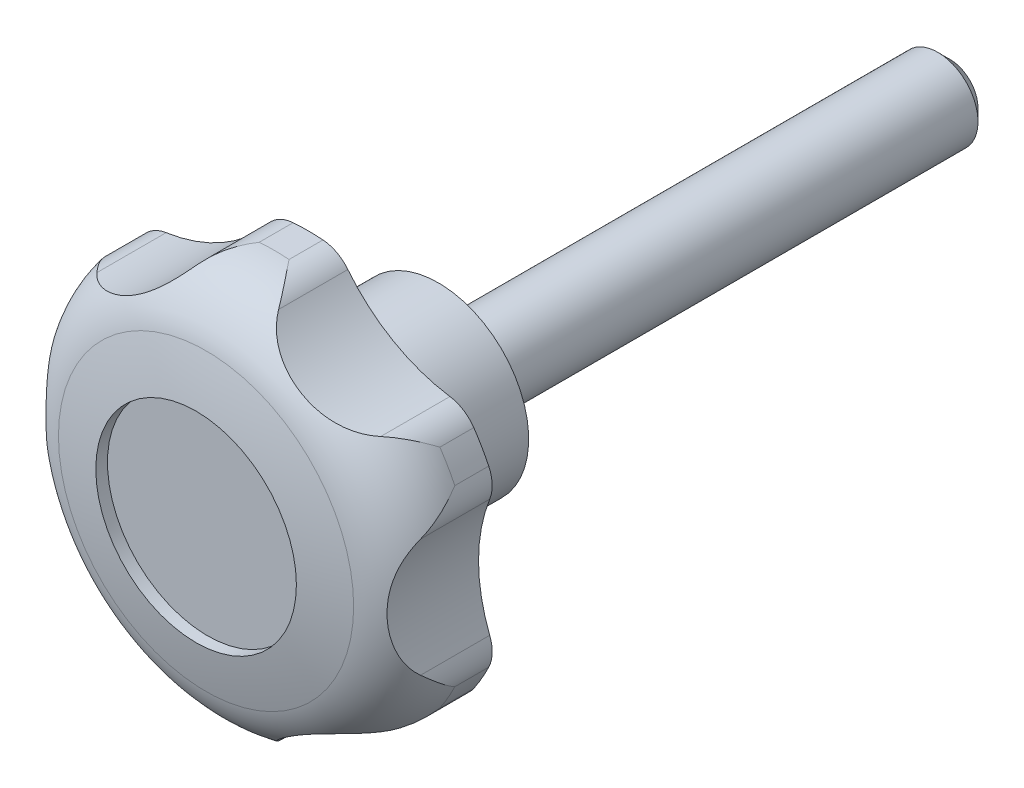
ISO-10303-21;
HEADER;
FILE_DESCRIPTION(('STEP AP214'),'2;1');
FILE_NAME('part.step','',(''),(''),'','','');
FILE_SCHEMA(('AUTOMOTIVE_DESIGN { 1 0 10303 214 1 1 1 1 }'));
ENDSEC;
DATA;
#1=APPLICATION_CONTEXT('core data for automotive mechanical design processes');
#2=APPLICATION_PROTOCOL_DEFINITION('international standard','automotive_design',2000,#1);
#3=PRODUCT_CONTEXT('',#1,'mechanical');
#4=PRODUCT('Part','Part','',(#3));
#5=PRODUCT_RELATED_PRODUCT_CATEGORY('part','',(#4));
#6=PRODUCT_DEFINITION_FORMATION('','',#4);
#7=PRODUCT_DEFINITION_CONTEXT('part definition',#1,'design');
#8=PRODUCT_DEFINITION('design','',#6,#7);
#9=PRODUCT_DEFINITION_SHAPE('','',#8);
#10=(LENGTH_UNIT() NAMED_UNIT(*) SI_UNIT(.MILLI.,.METRE.));
#11=(NAMED_UNIT(*) PLANE_ANGLE_UNIT() SI_UNIT($,.RADIAN.));
#12=(NAMED_UNIT(*) SI_UNIT($,.STERADIAN.) SOLID_ANGLE_UNIT());
#13=UNCERTAINTY_MEASURE_WITH_UNIT(LENGTH_MEASURE(1.E-05),#10,'distance_accuracy_value','');
#14=(GEOMETRIC_REPRESENTATION_CONTEXT(3) GLOBAL_UNCERTAINTY_ASSIGNED_CONTEXT((#13)) GLOBAL_UNIT_ASSIGNED_CONTEXT((#10,
#11,#12)) REPRESENTATION_CONTEXT('',''));
#15=CARTESIAN_POINT('',(0.,0.,0.));
#16=DIRECTION('',(0.,0.,1.));
#17=DIRECTION('',(1.,0.,0.));
#18=AXIS2_PLACEMENT_3D('',#15,#16,#17);
#19=CARTESIAN_POINT('',(0.,0.,-34.0000000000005));
#20=DIRECTION('',(-1.,0.,0.));
#21=DIRECTION('',(0.,0.,-1.));
#22=AXIS2_PLACEMENT_3D('',#19,#20,#21);
#23=SPHERICAL_SURFACE('',#22,60.);
#24=CARTESIAN_POINT('',(0.,0.,-34.0000000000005));
#25=DIRECTION('',(0.,0.,1.));
#26=DIRECTION('',(-1.,0.,0.));
#27=AXIS2_PLACEMENT_3D('',#24,#25,#26);
#28=SPHERICAL_SURFACE('',#27,60.);
#29=CARTESIAN_POINT('',(0.,0.,24.167090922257));
#30=DIRECTION('',(0.,0.,1.));
#31=DIRECTION('',(-1.,0.,0.));
#32=AXIS2_PLACEMENT_3D('',#29,#30,#31);
#33=CIRCLE('',#32,14.7169811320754);
#34=CARTESIAN_POINT('',(-14.7169811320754,0.,24.167090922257));
#35=VERTEX_POINT('',#34);
#36=EDGE_CURVE('E682',#35,#35,#33,.T.);
#37=ORIENTED_EDGE('',*,*,#36,.T.);
#38=EDGE_LOOP('',(#37));
#39=FACE_BOUND('',#38,.T.);
#40=CARTESIAN_POINT('',(0.,0.,25.160797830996));
#41=DIRECTION('',(0.,0.,-1.));
#42=DIRECTION('',(1.,0.,0.));
#43=AXIS2_PLACEMENT_3D('',#40,#41,#42);
#44=CIRCLE('',#43,10.);
#45=CARTESIAN_POINT('',(10.,0.,25.160797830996));
#46=VERTEX_POINT('',#45);
#47=EDGE_CURVE('E191',#46,#46,#44,.T.);
#48=ORIENTED_EDGE('',*,*,#47,.T.);
#49=EDGE_LOOP('',(#48));
#50=FACE_BOUND('',#49,.T.);
#51=ADVANCED_FACE('F14',(#39,#50),#28,.T.);
#52=CARTESIAN_POINT('',(0.,0.,32.5455656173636));
#53=DIRECTION('',(0.,0.,1.));
#54=DIRECTION('',(-1.,0.,0.));
#55=AXIS2_PLACEMENT_3D('',#52,#53,#54);
#56=CYLINDRICAL_SURFACE('',#55,20.);
#57=CARTESIAN_POINT('',(0.,0.,14.));
#58=DIRECTION('',(0.,0.,1.));
#59=DIRECTION('',(-1.,0.,0.));
#60=AXIS2_PLACEMENT_3D('',#57,#58,#59);
#61=CIRCLE('',#60,20.);
#62=CARTESIAN_POINT('',(1.4880574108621,19.9445653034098,13.9999999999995));
#63=VERTEX_POINT('',#62);
#64=CARTESIAN_POINT('',(-1.48805741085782,19.94456530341,13.9999999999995));
#65=VERTEX_POINT('',#64);
#66=EDGE_CURVE('E470',#63,#65,#61,.T.);
#67=ORIENTED_EDGE('',*,*,#66,.T.);
#68=DIRECTION('',(0.,0.,1.));
#69=VECTOR('',#68,1.);
#70=CARTESIAN_POINT('',(-1.48805741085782,19.94456530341,-49.));
#71=LINE('',#70,#69);
#72=CARTESIAN_POINT('',(-1.48805741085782,19.94456530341,17.38093031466));
#73=VERTEX_POINT('',#72);
#74=EDGE_CURVE('E182',#65,#73,#71,.T.);
#75=ORIENTED_EDGE('',*,*,#74,.T.);
#76=CARTESIAN_POINT('',(0.,0.,17.38093031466));
#77=DIRECTION('',(0.,0.,1.));
#78=DIRECTION('',(-1.,0.,0.));
#79=AXIS2_PLACEMENT_3D('',#76,#77,#78);
#80=CIRCLE('',#79,20.);
#81=CARTESIAN_POINT('',(1.4880574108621,19.9445653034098,17.38093031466));
#82=VERTEX_POINT('',#81);
#83=EDGE_CURVE('E198',#82,#73,#80,.T.);
#84=ORIENTED_EDGE('',*,*,#83,.F.);
#85=DIRECTION('',(0.,0.,1.));
#86=VECTOR('',#85,1.);
#87=CARTESIAN_POINT('',(1.4880574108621,19.9445653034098,-49.));
#88=LINE('',#87,#86);
#89=EDGE_CURVE('E637',#63,#82,#88,.T.);
#90=ORIENTED_EDGE('',*,*,#89,.F.);
#91=EDGE_LOOP('',(#67,#75,#84,#90));
#92=FACE_BOUND('',#91,.T.);
#93=ADVANCED_FACE('F437',(#92),#56,.T.);
#94=CARTESIAN_POINT('',(18.0165289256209,8.68358713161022,13.9999999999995));
#95=VERTEX_POINT('',#94);
#96=CARTESIAN_POINT('',(16.5284715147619,11.2609781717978,14.));
#97=VERTEX_POINT('',#96);
#98=EDGE_CURVE('E474',#95,#97,#61,.T.);
#99=ORIENTED_EDGE('',*,*,#98,.T.);
#100=DIRECTION('',(0.,0.,1.));
#101=VECTOR('',#100,1.);
#102=CARTESIAN_POINT('',(16.5284715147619,11.2609781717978,-49.));
#103=LINE('',#102,#101);
#104=CARTESIAN_POINT('',(16.5284715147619,11.2609781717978,17.38093031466));
#105=VERTEX_POINT('',#104);
#106=EDGE_CURVE('E502',#97,#105,#103,.T.);
#107=ORIENTED_EDGE('',*,*,#106,.T.);
#108=CARTESIAN_POINT('',(18.0165289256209,8.68358713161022,17.38093031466));
#109=VERTEX_POINT('',#108);
#110=EDGE_CURVE('E675',#109,#105,#80,.T.);
#111=ORIENTED_EDGE('',*,*,#110,.F.);
#112=DIRECTION('',(0.,0.,1.));
#113=VECTOR('',#112,1.);
#114=CARTESIAN_POINT('',(18.0165289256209,8.68358713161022,-49.));
#115=LINE('',#114,#113);
#116=EDGE_CURVE('E504',#95,#109,#115,.T.);
#117=ORIENTED_EDGE('',*,*,#116,.F.);
#118=EDGE_LOOP('',(#99,#107,#111,#117));
#119=FACE_BOUND('',#118,.T.);
#120=ADVANCED_FACE('F439',(#119),#56,.T.);
#121=CARTESIAN_POINT('',(16.5284715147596,-11.260978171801,13.9999999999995));
#122=VERTEX_POINT('',#121);
#123=CARTESIAN_POINT('',(18.0165289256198,-8.68358713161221,14.));
#124=VERTEX_POINT('',#123);
#125=EDGE_CURVE('E487',#122,#124,#61,.T.);
#126=ORIENTED_EDGE('',*,*,#125,.T.);
#127=DIRECTION('',(0.,0.,1.));
#128=VECTOR('',#127,1.);
#129=CARTESIAN_POINT('',(18.0165289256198,-8.68358713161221,-49.));
#130=LINE('',#129,#128);
#131=CARTESIAN_POINT('',(18.0165289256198,-8.68358713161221,17.38093031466));
#132=VERTEX_POINT('',#131);
#133=EDGE_CURVE('E623',#124,#132,#130,.T.);
#134=ORIENTED_EDGE('',*,*,#133,.T.);
#135=CARTESIAN_POINT('',(16.5284715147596,-11.260978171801,17.38093031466));
#136=VERTEX_POINT('',#135);
#137=EDGE_CURVE('E677',#136,#132,#80,.T.);
#138=ORIENTED_EDGE('',*,*,#137,.F.);
#139=DIRECTION('',(0.,0.,1.));
#140=VECTOR('',#139,1.);
#141=CARTESIAN_POINT('',(16.5284715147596,-11.260978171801,-49.));
#142=LINE('',#141,#140);
#143=EDGE_CURVE('E621',#122,#136,#142,.T.);
#144=ORIENTED_EDGE('',*,*,#143,.F.);
#145=EDGE_LOOP('',(#126,#134,#138,#144));
#146=FACE_BOUND('',#145,.T.);
#147=ADVANCED_FACE('F448',(#146),#56,.T.);
#148=CARTESIAN_POINT('',(-1.48805741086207,-19.9445653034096,13.9999999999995));
#149=VERTEX_POINT('',#148);
#150=CARTESIAN_POINT('',(1.48805741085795,-19.94456530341,14.));
#151=VERTEX_POINT('',#150);
#152=EDGE_CURVE('E481',#149,#151,#61,.T.);
#153=ORIENTED_EDGE('',*,*,#152,.T.);
#154=DIRECTION('',(0.,0.,1.));
#155=VECTOR('',#154,1.);
#156=CARTESIAN_POINT('',(1.48805741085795,-19.94456530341,-49.));
#157=LINE('',#156,#155);
#158=CARTESIAN_POINT('',(1.48805741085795,-19.94456530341,17.38093031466));
#159=VERTEX_POINT('',#158);
#160=EDGE_CURVE('E613',#151,#159,#157,.T.);
#161=ORIENTED_EDGE('',*,*,#160,.T.);
#162=CARTESIAN_POINT('',(-1.48805741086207,-19.9445653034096,17.38093031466));
#163=VERTEX_POINT('',#162);
#164=EDGE_CURVE('E679',#163,#159,#80,.T.);
#165=ORIENTED_EDGE('',*,*,#164,.F.);
#166=DIRECTION('',(0.,0.,1.));
#167=VECTOR('',#166,1.);
#168=CARTESIAN_POINT('',(-1.48805741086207,-19.9445653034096,-49.));
#169=LINE('',#168,#167);
#170=EDGE_CURVE('E611',#149,#163,#169,.T.);
#171=ORIENTED_EDGE('',*,*,#170,.F.);
#172=EDGE_LOOP('',(#153,#161,#165,#171));
#173=FACE_BOUND('',#172,.T.);
#174=ADVANCED_FACE('F460',(#173),#56,.T.);
#175=CARTESIAN_POINT('',(-18.0165289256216,-8.68358713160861,13.9999999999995));
#176=VERTEX_POINT('',#175);
#177=CARTESIAN_POINT('',(-16.5284715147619,-11.2609781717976,14.));
#178=VERTEX_POINT('',#177);
#179=EDGE_CURVE('E473',#176,#178,#61,.T.);
#180=ORIENTED_EDGE('',*,*,#179,.T.);
#181=DIRECTION('',(0.,0.,1.));
#182=VECTOR('',#181,1.);
#183=CARTESIAN_POINT('',(-16.5284715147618,-11.2609781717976,-49.));
#184=LINE('',#183,#182);
#185=CARTESIAN_POINT('',(-16.5284715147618,-11.2609781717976,17.38093031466));
#186=VERTEX_POINT('',#185);
#187=EDGE_CURVE('E603',#178,#186,#184,.T.);
#188=ORIENTED_EDGE('',*,*,#187,.T.);
#189=CARTESIAN_POINT('',(-18.0165289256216,-8.68358713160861,17.38093031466));
#190=VERTEX_POINT('',#189);
#191=EDGE_CURVE('E485',#190,#186,#80,.T.);
#192=ORIENTED_EDGE('',*,*,#191,.F.);
#193=DIRECTION('',(0.,0.,1.));
#194=VECTOR('',#193,1.);
#195=CARTESIAN_POINT('',(-18.0165289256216,-8.68358713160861,-49.));
#196=LINE('',#195,#194);
#197=EDGE_CURVE('E601',#176,#190,#196,.T.);
#198=ORIENTED_EDGE('',*,*,#197,.F.);
#199=EDGE_LOOP('',(#180,#188,#192,#198));
#200=FACE_BOUND('',#199,.T.);
#201=ADVANCED_FACE('F453',(#200),#56,.T.);
#202=CARTESIAN_POINT('',(-16.5284715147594,11.2609781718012,13.9999999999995));
#203=VERTEX_POINT('',#202);
#204=CARTESIAN_POINT('',(-18.0165289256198,8.68358713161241,14.));
#205=VERTEX_POINT('',#204);
#206=EDGE_CURVE('E465',#203,#205,#61,.T.);
#207=ORIENTED_EDGE('',*,*,#206,.T.);
#208=DIRECTION('',(0.,0.,1.));
#209=VECTOR('',#208,1.);
#210=CARTESIAN_POINT('',(-18.0165289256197,8.68358713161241,-49.));
#211=LINE('',#210,#209);
#212=CARTESIAN_POINT('',(-18.0165289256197,8.68358713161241,17.38093031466));
#213=VERTEX_POINT('',#212);
#214=EDGE_CURVE('E37',#205,#213,#211,.T.);
#215=ORIENTED_EDGE('',*,*,#214,.T.);
#216=CARTESIAN_POINT('',(-16.5284715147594,11.2609781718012,17.38093031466));
#217=VERTEX_POINT('',#216);
#218=EDGE_CURVE('E480',#217,#213,#80,.T.);
#219=ORIENTED_EDGE('',*,*,#218,.F.);
#220=DIRECTION('',(0.,0.,1.));
#221=VECTOR('',#220,1.);
#222=CARTESIAN_POINT('',(-16.5284715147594,11.2609781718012,-49.));
#223=LINE('',#222,#221);
#224=EDGE_CURVE('E468',#203,#217,#223,.T.);
#225=ORIENTED_EDGE('',*,*,#224,.F.);
#226=EDGE_LOOP('',(#207,#215,#219,#225));
#227=FACE_BOUND('',#226,.T.);
#228=ADVANCED_FACE('F441',(#227),#56,.T.);
#229=CARTESIAN_POINT('',(0.,0.,17.38093031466));
#230=DIRECTION('',(0.,0.,1.));
#231=DIRECTION('',(-1.,0.,0.));
#232=AXIS2_PLACEMENT_3D('',#229,#230,#231);
#233=TOROIDAL_SURFACE('',#232,13.,7.);
#234=CARTESIAN_POINT('',(1.48805741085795,19.94456530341,17.38093031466));
#235=CARTESIAN_POINT('',(1.49147422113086,19.9443103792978,17.3853314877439));
#236=CARTESIAN_POINT('',(1.49489072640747,19.9440504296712,17.3897327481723));
#237=CARTESIAN_POINT('',(1.81379375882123,19.9193149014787,17.8006005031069));
#238=CARTESIAN_POINT('',(2.12658065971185,19.8519874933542,18.20777523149));
#239=CARTESIAN_POINT('',(2.72890668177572,19.632187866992,19.0173039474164));
#240=CARTESIAN_POINT('',(3.01841511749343,19.4796053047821,19.4196509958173));
#241=CARTESIAN_POINT('',(3.41111362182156,19.1940432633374,20.000662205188));
#242=CARTESIAN_POINT('',(3.53138560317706,19.0939385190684,20.1842811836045));
#243=CARTESIAN_POINT('',(3.75978456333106,18.8756523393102,20.5475677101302));
#244=CARTESIAN_POINT('',(3.86793749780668,18.7575108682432,20.7272430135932));
#245=CARTESIAN_POINT('',(3.96899762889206,18.6302715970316,20.9047576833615));
#246=B_SPLINE_CURVE_WITH_KNOTS('',3,(#234,#235,#236,#237,#238,#239,#240,#241,#242,#243,#244,
#245),.UNSPECIFIED.,.F.,.F.,(4,2,2,2,2,4),(0.,0.0167332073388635,1.56205380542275,
3.10937912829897,3.83223807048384,4.55351799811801),.UNSPECIFIED.);
#247=CARTESIAN_POINT('',(3.96883886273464,18.6304715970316,20.9044786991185));
#248=VERTEX_POINT('',#247);
#249=EDGE_CURVE('E200',#82,#248,#246,.T.);
#250=ORIENTED_EDGE('',*,*,#249,.F.);
#251=ORIENTED_EDGE('',*,*,#83,.T.);
#252=CARTESIAN_POINT('',(-3.96899762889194,18.6302715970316,20.9047576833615));
#253=CARTESIAN_POINT('',(-3.87488306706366,18.7487894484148,20.7394301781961));
#254=CARTESIAN_POINT('',(-3.77455997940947,18.859445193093,20.5721519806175));
#255=CARTESIAN_POINT('',(-3.56354943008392,19.0648747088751,20.234567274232));
#256=CARTESIAN_POINT('',(-3.45286825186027,19.159658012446,20.064262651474));
#257=CARTESIAN_POINT('',(-3.22337066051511,19.3331052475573,19.7217368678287));
#258=CARTESIAN_POINT('',(-3.10457584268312,19.4118099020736,19.5495217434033));
#259=CARTESIAN_POINT('',(-2.86030415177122,19.5533565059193,19.2033602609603));
#260=CARTESIAN_POINT('',(-2.73482744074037,19.6161988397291,19.0294139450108));
#261=CARTESIAN_POINT('',(-2.42924956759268,19.7472078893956,18.6128190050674));
#262=CARTESIAN_POINT('',(-2.24677265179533,19.8080525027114,18.3695899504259));
#263=CARTESIAN_POINT('',(-1.87597960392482,19.8989790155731,17.8822329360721));
#264=CARTESIAN_POINT('',(-1.68767071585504,19.9290976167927,17.6381063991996));
#265=CARTESIAN_POINT('',(-1.49489075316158,19.9440504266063,17.3897327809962));
#266=CARTESIAN_POINT('',(-1.49147424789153,19.9443103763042,17.3853315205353));
#267=CARTESIAN_POINT('',(-1.48805741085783,19.94456530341,17.38093031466));
#268=B_SPLINE_CURVE_WITH_KNOTS('',3,(#252,#253,#254,#255,#256,#257,#258,#259,#260,#261,#262,
#263,#264,#265,#266,#267),.UNSPECIFIED.,.F.,.F.,(4,2,2,2,2,2,2,4),(0.,0.672016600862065,
1.34362815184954,2.01351700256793,2.68338961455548,3.61205098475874,4.53960178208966,
4.55633498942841),.UNSPECIFIED.);
#269=CARTESIAN_POINT('',(-3.96883886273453,18.6304715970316,20.9044786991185));
#270=VERTEX_POINT('',#269);
#271=EDGE_CURVE('E186',#270,#73,#268,.T.);
#272=ORIENTED_EDGE('',*,*,#271,.F.);
#273=CARTESIAN_POINT('',(-3.96868008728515,18.6306715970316,20.9041996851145));
#274=CARTESIAN_POINT('',(-4.04437009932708,18.5352984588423,21.0373324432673));
#275=CARTESIAN_POINT('',(-4.12526413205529,18.4356613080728,21.1643450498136));
#276=CARTESIAN_POINT('',(-4.29682494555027,18.2299121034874,21.4055808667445));
#277=CARTESIAN_POINT('',(-4.3874794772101,18.1238082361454,21.5198197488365));
#278=CARTESIAN_POINT('',(-4.57713747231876,17.9080462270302,21.734184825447));
#279=CARTESIAN_POINT('',(-4.67604562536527,17.7984357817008,21.8344439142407));
#280=CARTESIAN_POINT('',(-4.8823807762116,17.5763891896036,22.0223145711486));
#281=CARTESIAN_POINT('',(-4.98981004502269,17.4639522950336,22.1099227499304));
#282=CARTESIAN_POINT('',(-5.21195811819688,17.2384215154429,22.2724206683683));
#283=CARTESIAN_POINT('',(-5.32664134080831,17.1253329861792,22.3473667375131));
#284=CARTESIAN_POINT('',(-5.56302161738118,16.8994018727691,22.4855727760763));
#285=CARTESIAN_POINT('',(-5.68471815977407,16.7865592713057,22.5488335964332));
#286=CARTESIAN_POINT('',(-5.93480326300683,16.5619776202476,22.664519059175));
#287=CARTESIAN_POINT('',(-6.06320974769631,16.4502425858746,22.716912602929));
#288=CARTESIAN_POINT('',(-6.32576627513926,16.2291643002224,22.8113760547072));
#289=CARTESIAN_POINT('',(-6.45991755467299,16.1198215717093,22.8534437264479));
#290=CARTESIAN_POINT('',(-6.79339160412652,15.8570291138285,22.9443164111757));
#291=CARTESIAN_POINT('',(-6.9954768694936,15.7052831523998,22.9879752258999));
#292=CARTESIAN_POINT('',(-7.40871955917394,15.410195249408,23.0571569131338));
#293=CARTESIAN_POINT('',(-7.61988028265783,15.2668564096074,23.0826731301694));
#294=CARTESIAN_POINT('',(-8.05020035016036,14.9896326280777,23.1167506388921));
#295=CARTESIAN_POINT('',(-8.26937403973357,14.8557660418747,23.1252798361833));
#296=CARTESIAN_POINT('',(-8.71390124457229,14.59876043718,23.1256982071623));
#297=CARTESIAN_POINT('',(-8.93925403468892,14.4756201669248,23.1175893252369));
#298=CARTESIAN_POINT('',(-9.39691071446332,14.2396244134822,23.0841784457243));
#299=CARTESIAN_POINT('',(-9.62926146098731,14.1268834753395,23.0587061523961));
#300=CARTESIAN_POINT('',(-10.0969036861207,13.9136966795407,22.9891901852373));
#301=CARTESIAN_POINT('',(-10.3321956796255,13.813253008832,22.9451432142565));
#302=CARTESIAN_POINT('',(-10.8026152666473,13.6254517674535,22.8367845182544));
#303=CARTESIAN_POINT('',(-11.0377415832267,13.5380595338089,22.7725279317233));
#304=CARTESIAN_POINT('',(-11.5052304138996,13.37642671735,22.6215210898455));
#305=CARTESIAN_POINT('',(-11.7375946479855,13.3021775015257,22.5347856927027));
#306=CARTESIAN_POINT('',(-12.1176745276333,13.1898767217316,22.3703811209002));
#307=CARTESIAN_POINT('',(-12.2673166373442,13.1480997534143,22.2996511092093));
#308=CARTESIAN_POINT('',(-12.5622706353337,13.0702110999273,22.1469698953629));
#309=CARTESIAN_POINT('',(-12.7075838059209,13.0340977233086,22.0650220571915));
#310=CARTESIAN_POINT('',(-12.992062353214,12.967442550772,21.8897703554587));
#311=CARTESIAN_POINT('',(-13.1312411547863,12.9368880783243,21.7964931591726));
#312=CARTESIAN_POINT('',(-13.4021505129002,12.880989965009,21.5983767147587));
#313=CARTESIAN_POINT('',(-13.5338850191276,12.8556435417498,21.4935436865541));
#314=CARTESIAN_POINT('',(-13.7470664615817,12.817207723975,21.3083350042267));
#315=CARTESIAN_POINT('',(-13.8309740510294,12.8028082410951,21.2310445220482));
#316=CARTESIAN_POINT('',(-13.9941817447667,12.7760624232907,21.0714083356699));
#317=CARTESIAN_POINT('',(-14.0734817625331,12.7637161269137,20.9890625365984));
#318=CARTESIAN_POINT('',(-14.1502422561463,12.7523213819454,20.9042577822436));
#319=B_SPLINE_CURVE_WITH_KNOTS('',3,(#273,#274,#275,#276,#277,#278,#279,#280,#281,#282,#283,
#284,#285,#286,#287,#288,#289,#290,#291,#292,#293,#294,#295,#296,#297,#298,#299,#300,#301,#302,
#303,#304,#305,#306,#307,#308,#309,#310,#311,#312,#313,#314,#315,#316,#317,#318),.UNSPECIFIED.,
.F.,.F.,(4,2,2,2,2,2,2,2,2,2,2,2,2,2,2,2,2,2,2,2,2,2,4),(0.,0.540904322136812,1.08113756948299,
1.61582234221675,2.1506500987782,2.6830320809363,3.215375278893,3.74922146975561,
4.28318317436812,5.05149336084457,5.82008525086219,6.59012790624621,7.36008057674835,
8.13769549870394,8.91544851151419,9.69109770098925,10.4662354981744,10.9779030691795,
11.4894175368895,11.9997505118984,12.5098101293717,12.8545587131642,13.1993137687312),.UNSPECIFIED.);
#320=CARTESIAN_POINT('',(-14.1500422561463,12.752351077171,20.9044786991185));
#321=VERTEX_POINT('',#320);
#322=EDGE_CURVE('E174',#270,#321,#319,.T.);
#323=ORIENTED_EDGE('',*,*,#322,.T.);
#324=CARTESIAN_POINT('',(-16.5284715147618,11.2609781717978,17.38093031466));
#325=CARTESIAN_POINT('',(-16.5265423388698,11.2638097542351,17.3853314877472));
#326=CARTESIAN_POINT('',(-16.5246089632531,11.2666385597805,17.3897327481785));
#327=CARTESIAN_POINT('',(-16.3437358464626,11.5304489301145,17.8006005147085));
#328=CARTESIAN_POINT('',(-16.1290351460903,11.7676666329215,18.2077752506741));
#329=CARTESIAN_POINT('',(-15.6375200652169,12.1793964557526,19.0173039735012));
#330=CARTESIAN_POINT('',(-15.360625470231,12.3538268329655,19.4196510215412));
#331=CARTESIAN_POINT('',(-14.9169799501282,12.5511292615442,20.0006521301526));
#332=CARTESIAN_POINT('',(-14.7701590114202,12.6052330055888,20.1842611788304));
#333=CARTESIAN_POINT('',(-14.4669357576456,12.69388650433,20.547528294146));
#334=CARTESIAN_POINT('',(-14.3105550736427,12.7284787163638,20.727194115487));
#335=CARTESIAN_POINT('',(-14.1498422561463,12.7523807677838,20.904699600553));
#336=B_SPLINE_CURVE_WITH_KNOTS('',3,(#324,#325,#326,#327,#328,#329,#330,#331,#332,#333,#334,
#335),.UNSPECIFIED.,.F.,.F.,(4,2,2,2,2,4),(0.,0.0167332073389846,1.56205384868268,
3.10937912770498,3.83219873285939,4.5534393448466),.UNSPECIFIED.);
#337=EDGE_CURVE('E181',#217,#321,#336,.T.);
#338=ORIENTED_EDGE('',*,*,#337,.F.);
#339=ORIENTED_EDGE('',*,*,#218,.T.);
#340=CARTESIAN_POINT('',(-18.1188021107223,5.8779205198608,20.904713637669));
#341=CARTESIAN_POINT('',(-18.1743828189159,6.01868604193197,20.7393849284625));
#342=CARTESIAN_POINT('',(-18.2200504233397,6.16089717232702,20.5721055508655));
#343=CARTESIAN_POINT('',(-18.2924491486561,6.4463540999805,20.2345185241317));
#344=CARTESIAN_POINT('',(-18.3191916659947,6.58959922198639,20.0642127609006));
#345=CARTESIAN_POINT('',(-18.3546491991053,6.87507491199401,19.7216847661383));
#346=CARTESIAN_POINT('',(-18.3634102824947,7.01730713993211,19.5494685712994));
#347=CARTESIAN_POINT('',(-18.3638538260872,7.29962689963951,19.2033049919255));
#348=CARTESIAN_POINT('',(-18.3555367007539,7.43971448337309,19.0293576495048));
#349=CARTESIAN_POINT('',(-18.3162014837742,7.76984941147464,18.612771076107));
#350=CARTESIAN_POINT('',(-18.2776557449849,7.95829337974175,18.3695515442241));
#351=CARTESIAN_POINT('',(-18.1710057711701,8.3248575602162,17.8822136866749));
#352=CARTESIAN_POINT('',(-18.1029369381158,8.50298984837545,17.638096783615));
#353=CARTESIAN_POINT('',(-18.0194997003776,8.67741184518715,17.3897327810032));
#354=CARTESIAN_POINT('',(-18.018016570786,8.68050060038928,17.3853315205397));
#355=CARTESIAN_POINT('',(-18.0165289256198,8.68358713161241,17.38093031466));
#356=B_SPLINE_CURVE_WITH_KNOTS('',3,(#340,#341,#342,#343,#344,#345,#346,#347,#348,#349,#350,
#351,#352,#353,#354,#355),.UNSPECIFIED.,.F.,.F.,(4,2,2,2,2,2,2,4),(0.,0.672020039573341,
1.34363505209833,2.01352725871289,2.6834032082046,3.61202792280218,4.5395421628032,
4.55627537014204),.UNSPECIFIED.);
#357=CARTESIAN_POINT('',(-18.1188811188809,5.87812051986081,20.9044786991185));
#358=VERTEX_POINT('',#357);
#359=EDGE_CURVE('E248',#358,#213,#356,.T.);
#360=ORIENTED_EDGE('',*,*,#359,.F.);
#361=CARTESIAN_POINT('',(-18.1189601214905,5.8783205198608,20.9042437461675));
#362=CARTESIAN_POINT('',(-18.0742090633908,5.76508237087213,21.0373759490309));
#363=CARTESIAN_POINT('',(-18.0283673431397,5.64520539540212,21.1643878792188));
#364=CARTESIAN_POINT('',(-17.9359630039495,5.393750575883,21.4056221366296));
#365=CARTESIAN_POINT('',(-17.8894013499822,5.26218743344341,21.5198601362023));
#366=CARTESIAN_POINT('',(-17.7973745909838,4.99005371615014,21.73422328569));
#367=CARTESIAN_POINT('',(-17.7519031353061,4.84958953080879,21.8344813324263));
#368=CARTESIAN_POINT('',(-17.6627726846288,4.55987085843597,22.0223497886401));
#369=CARTESIAN_POINT('',(-17.6191141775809,4.41061403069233,22.1099568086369));
#370=CARTESIAN_POINT('',(-17.5348731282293,4.10545908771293,22.2724523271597));
#371=CARTESIAN_POINT('',(-17.4942774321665,3.9495944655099,22.3473971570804));
#372=CARTESIAN_POINT('',(-17.4168061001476,3.63191414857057,22.4856006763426));
#373=CARTESIAN_POINT('',(-17.3799301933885,3.47009888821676,22.54886021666));
#374=CARTESIAN_POINT('',(-17.3104802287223,3.14122478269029,22.6645431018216));
#375=CARTESIAN_POINT('',(-17.2779186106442,2.97415242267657,22.7169353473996));
#376=CARTESIAN_POINT('',(-17.2177386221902,2.63622963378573,22.8113961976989));
#377=CARTESIAN_POINT('',(-17.1901213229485,2.46537839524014,22.8534625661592));
#378=CARTESIAN_POINT('',(-17.1292751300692,2.04518192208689,22.9443320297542));
#379=CARTESIAN_POINT('',(-17.098903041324,1.7942962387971,22.9879889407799));
#380=CARTESIAN_POINT('',(-17.0499732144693,1.28887036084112,23.0571668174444));
#381=CARTESIAN_POINT('',(-17.0314198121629,1.03432885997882,23.0826811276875));
#382=CARTESIAN_POINT('',(-17.0064997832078,0.523045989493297,23.1167547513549));
#383=CARTESIAN_POINT('',(-17.0001562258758,0.266301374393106,23.1252819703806));
#384=CARTESIAN_POINT('',(-16.9998494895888,-0.247175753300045,23.125696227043));
#385=CARTESIAN_POINT('',(-17.0058848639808,-0.503908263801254,23.1175852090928));
#386=CARTESIAN_POINT('',(-17.0303381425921,-1.01825026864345,23.0841697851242));
#387=CARTESIAN_POINT('',(-17.0488786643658,-1.2758430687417,23.0586950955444));
#388=CARTESIAN_POINT('',(-17.098077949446,-1.78742757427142,22.9891739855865));
#389=CARTESIAN_POINT('',(-17.128738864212,-2.04141863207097,22.9451242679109));
#390=CARTESIAN_POINT('',(-17.2013113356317,-2.54271489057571,22.8367596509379));
#391=CARTESIAN_POINT('',(-17.2431922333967,-2.7900363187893,22.7724998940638));
#392=CARTESIAN_POINT('',(-17.3369616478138,-3.27570930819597,22.6214862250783));
#393=CARTESIAN_POINT('',(-17.3888435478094,-3.51406667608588,22.5347471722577));
#394=CARTESIAN_POINT('',(-17.4816300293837,-3.89937284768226,22.3703368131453));
#395=CARTESIAN_POINT('',(-17.5202715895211,-4.04985295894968,22.2996049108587));
#396=CARTESIAN_POINT('',(-17.6002956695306,-4.34423029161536,22.1469199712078));
#397=CARTESIAN_POINT('',(-17.6416773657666,-4.48812946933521,22.0649702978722));
#398=CARTESIAN_POINT('',(-17.7261917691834,-4.76781773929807,21.8897150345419));
#399=CARTESIAN_POINT('',(-17.769320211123,-4.90362479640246,21.796436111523));
#400=CARTESIAN_POINT('',(-17.8563654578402,-5.1661829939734,21.5983163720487));
#401=CARTESIAN_POINT('',(-17.9002818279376,-5.29293894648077,21.4934817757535));
#402=CARTESIAN_POINT('',(-17.9735824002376,-5.49676399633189,21.3082786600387));
#403=CARTESIAN_POINT('',(-18.0030624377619,-5.57661965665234,21.2309958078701));
#404=CARTESIAN_POINT('',(-18.0614968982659,-5.73131526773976,21.0713760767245));
#405=CARTESIAN_POINT('',(-18.0904513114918,-5.80615512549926,20.9890391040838));
#406=CARTESIAN_POINT('',(-18.1189601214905,-5.87832051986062,20.9042437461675));
#407=B_SPLINE_CURVE_WITH_KNOTS('',3,(#361,#362,#363,#364,#365,#366,#367,#368,#369,#370,#371,
#372,#373,#374,#375,#376,#377,#378,#379,#380,#381,#382,#383,#384,#385,#386,#387,#388,#389,#390,
#391,#392,#393,#394,#395,#396,#397,#398,#399,#400,#401,#402,#403,#404,#405,#406),.UNSPECIFIED.,
.F.,.F.,(4,2,2,2,2,2,2,2,2,2,2,2,2,2,2,2,2,2,2,2,2,2,4),(0.,0.540907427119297,1.08114375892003,
1.61583154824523,2.15066232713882,2.68304725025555,3.21539338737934,3.7492425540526,
4.28320723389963,5.05152112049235,5.82011670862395,6.59016306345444,7.3601194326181,
8.13773742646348,8.91549351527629,9.69114566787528,10.4662863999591,10.9779506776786,
11.4894618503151,11.9997915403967,12.5098478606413,12.8545572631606,13.199273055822),.UNSPECIFIED.);
#408=CARTESIAN_POINT('',(-18.1188811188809,-5.87812051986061,20.9044786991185));
#409=VERTEX_POINT('',#408);
#410=EDGE_CURVE('E254',#358,#409,#407,.T.);
#411=ORIENTED_EDGE('',*,*,#410,.T.);
#412=CARTESIAN_POINT('',(-18.0165289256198,-8.68358713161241,17.38093031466));
#413=CARTESIAN_POINT('',(-18.0180165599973,-8.68050062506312,17.3853314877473));
#414=CARTESIAN_POINT('',(-18.0194996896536,-8.67741186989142,17.3897327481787));
#415=CARTESIAN_POINT('',(-18.1575296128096,-8.38886597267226,17.8006005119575));
#416=CARTESIAN_POINT('',(-18.2556158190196,-8.08432086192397,18.2077752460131));
#417=CARTESIAN_POINT('',(-18.3664267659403,-7.45279140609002,19.0173039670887));
#418=CARTESIAN_POINT('',(-18.3790406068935,-7.12577846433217,19.4196510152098));
#419=CARTESIAN_POINT('',(-18.3280865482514,-6.64291693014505,20.0006545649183));
#420=CARTESIAN_POINT('',(-18.3015308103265,-6.48871235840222,20.184266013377));
#421=CARTESIAN_POINT('',(-18.226693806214,-6.18178255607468,20.5475378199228));
#422=CARTESIAN_POINT('',(-18.1784601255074,-6.02905482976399,20.7272059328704));
#423=CARTESIAN_POINT('',(-18.1188021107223,-5.87792051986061,20.904713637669));
#424=B_SPLINE_CURVE_WITH_KNOTS('',3,(#412,#413,#414,#415,#416,#417,#418,#419,#420,#421,#422,
#423),.UNSPECIFIED.,.F.,.F.,(4,2,2,2,2,4),(0.,0.0167332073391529,1.56205383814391,
3.1093791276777,3.83220823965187,4.55345835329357),.UNSPECIFIED.);
#425=EDGE_CURVE('E276',#190,#409,#424,.T.);
#426=ORIENTED_EDGE('',*,*,#425,.F.);
#427=ORIENTED_EDGE('',*,*,#191,.T.);
#428=CARTESIAN_POINT('',(-14.1498422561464,-12.7523807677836,20.9046996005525));
#429=CARTESIAN_POINT('',(-14.2995391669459,-12.7301317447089,20.739370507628));
#430=CARTESIAN_POINT('',(-14.4455314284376,-12.6985749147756,20.5720907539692));
#431=CARTESIAN_POINT('',(-14.7289436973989,-12.6185444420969,20.23450298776));
#432=CARTESIAN_POINT('',(-14.8663688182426,-12.5700810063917,20.0641968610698));
#433=CARTESIAN_POINT('',(-15.1313266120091,-12.4580491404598,19.7216681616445));
#434=CARTESIAN_POINT('',(-15.2588837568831,-12.3945197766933,19.549451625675));
#435=CARTESIAN_POINT('',(-15.5036013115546,-12.2537428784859,19.2032873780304));
#436=CARTESIAN_POINT('',(-15.620761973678,-12.1764956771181,19.0293397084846));
#437=CARTESIAN_POINT('',(-15.8869968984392,-11.977363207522,18.6127558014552));
#438=CARTESIAN_POINT('',(-16.0309190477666,-11.8497608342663,18.3695393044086));
#439=CARTESIAN_POINT('',(-16.2950440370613,-11.5741201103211,17.8822075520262));
#440=CARTESIAN_POINT('',(-16.4152750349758,-11.4261063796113,17.6380937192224));
#441=CARTESIAN_POINT('',(-16.5246089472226,-11.2666385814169,17.3897327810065));
#442=CARTESIAN_POINT('',(-16.5265423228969,-11.2638097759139,17.3853315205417));
#443=CARTESIAN_POINT('',(-16.5284715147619,-11.2609781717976,17.38093031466));
#444=B_SPLINE_CURVE_WITH_KNOTS('',3,(#428,#429,#430,#431,#432,#433,#434,#435,#436,#437,#438,
#439,#440,#441,#442,#443),.UNSPECIFIED.,.F.,.F.,(4,2,2,2,2,2,2,4),(0.,0.672021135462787,
1.34363725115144,2.01353052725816,2.68340754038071,3.6120205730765,4.53952316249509,
4.5562563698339),.UNSPECIFIED.);
#445=CARTESIAN_POINT('',(-14.1500422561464,-12.7523510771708,20.9044786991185));
#446=VERTEX_POINT('',#445);
#447=EDGE_CURVE('E282',#446,#186,#444,.T.);
#448=ORIENTED_EDGE('',*,*,#447,.F.);
#449=CARTESIAN_POINT('',(-14.1502422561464,-12.7523213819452,20.9042577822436));
#450=CARTESIAN_POINT('',(-14.0297989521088,-12.7701850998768,21.0373898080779));
#451=CARTESIAN_POINT('',(-13.903060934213,-12.790423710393,21.1644015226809));
#452=CARTESIAN_POINT('',(-13.6390912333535,-12.8361270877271,21.4056352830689));
#453=CARTESIAN_POINT('',(-13.5018727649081,-12.8615853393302,21.519873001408));
#454=CARTESIAN_POINT('',(-13.2201834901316,-12.917955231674,21.7342355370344));
#455=CARTESIAN_POINT('',(-13.075801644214,-12.9488081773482,21.8344932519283));
#456=CARTESIAN_POINT('',(-12.7803316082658,-13.0164788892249,22.0223610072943));
#457=CARTESIAN_POINT('',(-12.6292416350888,-13.053298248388,22.1099676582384));
#458=CARTESIAN_POINT('',(-12.3228482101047,-13.1329214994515,22.2724624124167));
#459=CARTESIAN_POINT('',(-12.1675671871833,-13.1756972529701,22.3474068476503));
#460=CARTESIAN_POINT('',(-11.8537114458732,-13.2674459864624,22.4856095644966));
#461=CARTESIAN_POINT('',(-11.6951369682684,-13.3164185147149,22.5488686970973));
#462=CARTESIAN_POINT('',(-11.3755979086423,-13.420710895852,22.6645507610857));
#463=CARTESIAN_POINT('',(-11.2146278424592,-13.476048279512,22.7169425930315));
#464=CARTESIAN_POINT('',(-10.8918874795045,-13.5928930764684,22.8114026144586));
#465=CARTESIAN_POINT('',(-10.7301170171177,-13.6544018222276,22.8534685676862));
#466=CARTESIAN_POINT('',(-10.3357924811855,-13.8118067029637,22.9443370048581));
#467=CARTESIAN_POINT('',(-10.1033327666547,-13.9109471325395,22.9879933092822));
#468=CARTESIAN_POINT('',(-9.64115569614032,-14.1212867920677,23.05716997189));
#469=CARTESIAN_POINT('',(-9.41143937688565,-14.2324904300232,23.0826836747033));
#470=CARTESIAN_POINT('',(-8.95619505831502,-14.4665517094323,23.1167560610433));
#471=CARTESIAN_POINT('',(-8.73067578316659,-14.5894309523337,23.1252826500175));
#472=CARTESIAN_POINT('',(-8.28583797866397,-14.8459051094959,23.1256955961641));
#473=CARTESIAN_POINT('',(-8.06651872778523,-14.9794987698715,23.1175838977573));
#474=CARTESIAN_POINT('',(-7.63331213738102,-15.2578481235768,23.0841670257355));
#475=CARTESIAN_POINT('',(-7.41950056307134,-15.402701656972,23.0586915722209));
#476=CARTESIAN_POINT('',(-7.0010552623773,-15.7011028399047,22.9891688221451));
#477=CARTESIAN_POINT('',(-6.796423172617,-15.8546520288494,22.94511822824));
#478=CARTESIAN_POINT('',(-6.39857455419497,-16.1681507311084,22.8367517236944));
#479=CARTESIAN_POINT('',(-6.20532864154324,-16.328081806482,22.7724909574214));
#480=CARTESIAN_POINT('',(-5.83160887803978,-16.6521257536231,22.6214751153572));
#481=CARTESIAN_POINT('',(-5.65112668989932,-16.8162357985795,22.5347348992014));
#482=CARTESIAN_POINT('',(-5.36383637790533,-17.0892441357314,22.3703228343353));
#483=CARTESIAN_POINT('',(-5.25283846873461,-17.1979482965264,22.2995904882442));
#484=CARTESIAN_POINT('',(-5.03791406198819,-17.414438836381,22.1469047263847));
#485=CARTESIAN_POINT('',(-4.93398545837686,-17.5222254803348,22.0649546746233));
#486=CARTESIAN_POINT('',(-4.73402726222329,-17.7352600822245,21.8896987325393));
#487=CARTESIAN_POINT('',(-4.63797997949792,-17.8405133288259,21.796419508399));
#488=CARTESIAN_POINT('',(-4.45412221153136,-18.0471745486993,21.5982992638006));
#489=CARTESIAN_POINT('',(-4.36630734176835,-18.1485845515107,21.4934644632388));
#490=CARTESIAN_POINT('',(-4.22643837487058,-18.3139795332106,21.3082572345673));
#491=CARTESIAN_POINT('',(-4.17201918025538,-18.3794406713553,21.2309701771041));
#492=CARTESIAN_POINT('',(-4.06726211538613,-18.5073995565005,21.0713415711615));
#493=CARTESIAN_POINT('',(-4.01692432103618,-18.569897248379,20.9889999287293));
#494=CARTESIAN_POINT('',(-3.96868008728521,-18.6306715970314,20.904199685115));
#495=B_SPLINE_CURVE_WITH_KNOTS('',3,(#449,#450,#451,#452,#453,#454,#455,#456,#457,#458,#459,
#460,#461,#462,#463,#464,#465,#466,#467,#468,#469,#470,#471,#472,#473,#474,#475,#476,#477,#478,
#479,#480,#481,#482,#483,#484,#485,#486,#487,#488,#489,#490,#491,#492,#493,#494),.UNSPECIFIED.,
.F.,.F.,(4,2,2,2,2,2,2,2,2,2,2,2,2,2,2,2,2,2,2,2,2,2,4),(0.,0.540908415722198,1.08114572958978,
1.61583448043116,2.1506662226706,2.68305208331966,3.21539915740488,3.74924927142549,
4.28321489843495,5.05152996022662,5.82012672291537,6.59017425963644,7.36013181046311,
8.1377507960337,8.91550787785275,9.69116096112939,10.4663026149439,10.9779647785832,
11.4894738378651,11.9998014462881,12.5098556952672,12.8545815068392,13.1993137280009),.UNSPECIFIED.);
#496=CARTESIAN_POINT('',(-3.96883886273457,-18.6304715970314,20.9044786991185));
#497=VERTEX_POINT('',#496);
#498=EDGE_CURVE('E288',#446,#497,#495,.T.);
#499=ORIENTED_EDGE('',*,*,#498,.T.);
#500=CARTESIAN_POINT('',(-1.48805741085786,-19.94456530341,17.38093031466));
#501=CARTESIAN_POINT('',(-1.49147422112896,-19.9443103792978,17.3853314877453));
#502=CARTESIAN_POINT('',(-1.4948907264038,-19.9440504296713,17.389732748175));
#503=CARTESIAN_POINT('',(-1.81379375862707,-19.9193149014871,17.800600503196));
#504=CARTESIAN_POINT('',(-2.12658065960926,-19.8519874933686,18.2077752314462));
#505=CARTESIAN_POINT('',(-2.72890668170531,-19.6321878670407,19.0173039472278));
#506=CARTESIAN_POINT('',(-3.01841511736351,-19.4796053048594,19.419650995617));
#507=CARTESIAN_POINT('',(-3.41111362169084,-19.19404326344,20.000662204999));
#508=CARTESIAN_POINT('',(-3.5313856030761,-19.0939385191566,20.184281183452));
#509=CARTESIAN_POINT('',(-3.75978456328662,-18.8756523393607,20.5475677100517));
#510=CARTESIAN_POINT('',(-3.86793749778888,-18.7575108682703,20.7272430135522));
#511=CARTESIAN_POINT('',(-3.968997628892,-18.6302715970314,20.9047576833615));
#512=B_SPLINE_CURVE_WITH_KNOTS('',3,(#500,#501,#502,#503,#504,#505,#506,#507,#508,#509,#510,
#511),.UNSPECIFIED.,.F.,.F.,(4,2,2,2,2,4),(0.,0.0167332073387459,1.56205380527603,
3.10937912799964,3.83223807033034,4.55351799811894),.UNSPECIFIED.);
#513=EDGE_CURVE('E295',#163,#497,#512,.T.);
#514=ORIENTED_EDGE('',*,*,#513,.F.);
#515=ORIENTED_EDGE('',*,*,#164,.T.);
#516=CARTESIAN_POINT('',(3.96899762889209,-18.6302715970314,20.9047576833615));
#517=CARTESIAN_POINT('',(3.87488306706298,-18.748789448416,20.739430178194));
#518=CARTESIAN_POINT('',(3.77455997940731,-18.8594451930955,20.5721519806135));
#519=CARTESIAN_POINT('',(3.56354943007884,-19.0648747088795,20.2345672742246));
#520=CARTESIAN_POINT('',(3.45286825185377,-19.1596580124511,20.0642626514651));
#521=CARTESIAN_POINT('',(3.22337066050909,-19.3331052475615,19.7217368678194));
#522=CARTESIAN_POINT('',(3.10457584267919,-19.4118099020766,19.5495217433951));
#523=CARTESIAN_POINT('',(2.86030415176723,-19.5533565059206,19.2033602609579));
#524=CARTESIAN_POINT('',(2.73482744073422,-19.61619883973,19.0294139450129));
#525=CARTESIAN_POINT('',(2.42924956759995,-19.7472078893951,18.6128190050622));
#526=CARTESIAN_POINT('',(2.24677265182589,-19.8080525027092,18.369589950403));
#527=CARTESIAN_POINT('',(1.87597960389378,-19.8989790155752,17.8822329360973));
#528=CARTESIAN_POINT('',(1.68767071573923,-19.9290976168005,17.6381063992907));
#529=CARTESIAN_POINT('',(1.49489075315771,-19.9440504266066,17.3897327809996));
#530=CARTESIAN_POINT('',(1.49147424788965,-19.9443103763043,17.385331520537));
#531=CARTESIAN_POINT('',(1.48805741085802,-19.94456530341,17.38093031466));
#532=B_SPLINE_CURVE_WITH_KNOTS('',3,(#516,#517,#518,#519,#520,#521,#522,#523,#524,#525,#526,
#527,#528,#529,#530,#531),.UNSPECIFIED.,.F.,.F.,(4,2,2,2,2,2,2,4),(0.,0.672016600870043,
1.34362815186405,2.01351700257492,2.68338961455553,3.6120509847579,4.53960178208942,
4.55633498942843),.UNSPECIFIED.);
#533=CARTESIAN_POINT('',(3.96883886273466,-18.6304715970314,20.9044786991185));
#534=VERTEX_POINT('',#533);
#535=EDGE_CURVE('E319',#534,#159,#532,.T.);
#536=ORIENTED_EDGE('',*,*,#535,.F.);
#537=CARTESIAN_POINT('',(3.96868008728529,-18.6306715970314,20.9041996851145));
#538=CARTESIAN_POINT('',(4.04437009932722,-18.5352984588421,21.0373324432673));
#539=CARTESIAN_POINT('',(4.12526413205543,-18.4356613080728,21.1643450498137));
#540=CARTESIAN_POINT('',(4.29682494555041,-18.2299121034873,21.4055808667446));
#541=CARTESIAN_POINT('',(4.38747947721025,-18.1238082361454,21.5198197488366));
#542=CARTESIAN_POINT('',(4.5771374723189,-17.9080462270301,21.734184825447));
#543=CARTESIAN_POINT('',(4.67604562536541,-17.7984357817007,21.8344439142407));
#544=CARTESIAN_POINT('',(4.88238077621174,-17.5763891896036,22.0223145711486));
#545=CARTESIAN_POINT('',(4.98981004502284,-17.4639522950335,22.1099227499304));
#546=CARTESIAN_POINT('',(5.21195811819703,-17.2384215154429,22.2724206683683));
#547=CARTESIAN_POINT('',(5.32664134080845,-17.1253329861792,22.3473667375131));
#548=CARTESIAN_POINT('',(5.5630216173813,-16.8994018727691,22.4855727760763));
#549=CARTESIAN_POINT('',(5.6847181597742,-16.7865592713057,22.5488335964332));
#550=CARTESIAN_POINT('',(5.93480326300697,-16.5619776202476,22.664519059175));
#551=CARTESIAN_POINT('',(6.06320974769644,-16.4502425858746,22.716912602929));
#552=CARTESIAN_POINT('',(6.32576627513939,-16.2291643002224,22.8113760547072));
#553=CARTESIAN_POINT('',(6.45991755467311,-16.1198215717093,22.8534437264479));
#554=CARTESIAN_POINT('',(6.79339160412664,-15.8570291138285,22.9443164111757));
#555=CARTESIAN_POINT('',(6.99547686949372,-15.7052831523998,22.9879752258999));
#556=CARTESIAN_POINT('',(7.40871955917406,-15.4101952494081,23.0571569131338));
#557=CARTESIAN_POINT('',(7.61988028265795,-15.2668564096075,23.0826731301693));
#558=CARTESIAN_POINT('',(8.05020035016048,-14.9896326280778,23.116750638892));
#559=CARTESIAN_POINT('',(8.26937403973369,-14.8557660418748,23.1252798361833));
#560=CARTESIAN_POINT('',(8.7139012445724,-14.59876043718,23.1256982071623));
#561=CARTESIAN_POINT('',(8.93925403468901,-14.4756201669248,23.1175893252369));
#562=CARTESIAN_POINT('',(9.3969107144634,-14.2396244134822,23.0841784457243));
#563=CARTESIAN_POINT('',(9.6292614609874,-14.1268834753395,23.058706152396));
#564=CARTESIAN_POINT('',(10.0969036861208,-13.9136966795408,22.9891901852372));
#565=CARTESIAN_POINT('',(10.3321956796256,-13.813253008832,22.9451432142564));
#566=CARTESIAN_POINT('',(10.8026152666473,-13.6254517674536,22.8367845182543));
#567=CARTESIAN_POINT('',(11.0377415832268,-13.538059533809,22.7725279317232));
#568=CARTESIAN_POINT('',(11.5052304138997,-13.37642671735,22.6215210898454));
#569=CARTESIAN_POINT('',(11.7375946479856,-13.3021775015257,22.5347856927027));
#570=CARTESIAN_POINT('',(12.1176745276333,-13.1898767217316,22.3703811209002));
#571=CARTESIAN_POINT('',(12.2673166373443,-13.1480997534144,22.2996511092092));
#572=CARTESIAN_POINT('',(12.5622706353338,-13.0702110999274,22.1469698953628));
#573=CARTESIAN_POINT('',(12.7075838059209,-13.0340977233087,22.0650220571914));
#574=CARTESIAN_POINT('',(12.992062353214,-12.9674425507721,21.8897703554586));
#575=CARTESIAN_POINT('',(13.1312411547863,-12.9368880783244,21.7964931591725));
#576=CARTESIAN_POINT('',(13.4021505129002,-12.8809899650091,21.5983767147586));
#577=CARTESIAN_POINT('',(13.5338850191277,-12.8556435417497,21.4935436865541));
#578=CARTESIAN_POINT('',(13.7470664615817,-12.817207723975,21.3083350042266));
#579=CARTESIAN_POINT('',(13.8309740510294,-12.8028082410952,21.2310445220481));
#580=CARTESIAN_POINT('',(13.9941817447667,-12.7760624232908,21.0714083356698));
#581=CARTESIAN_POINT('',(14.0734817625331,-12.7637161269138,20.9890625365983));
#582=CARTESIAN_POINT('',(14.1502422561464,-12.7523213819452,20.9042577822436));
#583=B_SPLINE_CURVE_WITH_KNOTS('',3,(#537,#538,#539,#540,#541,#542,#543,#544,#545,#546,#547,
#548,#549,#550,#551,#552,#553,#554,#555,#556,#557,#558,#559,#560,#561,#562,#563,#564,#565,#566,
#567,#568,#569,#570,#571,#572,#573,#574,#575,#576,#577,#578,#579,#580,#581,#582),.UNSPECIFIED.,
.F.,.F.,(4,2,2,2,2,2,2,2,2,2,2,2,2,2,2,2,2,2,2,2,2,2,4),(0.,0.540904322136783,1.08113756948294,
1.61582234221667,2.1506500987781,2.68303208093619,3.21537527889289,3.74922146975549,
4.28318317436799,5.05149336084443,5.82008525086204,6.59012790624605,7.36008057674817,
8.13769549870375,8.91544851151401,9.69109770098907,10.4662354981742,10.9779030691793,
11.4894175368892,11.9997505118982,12.5098101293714,12.854558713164,13.199313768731),.UNSPECIFIED.);
#584=CARTESIAN_POINT('',(14.1500422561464,-12.7523510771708,20.9044786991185));
#585=VERTEX_POINT('',#584);
#586=EDGE_CURVE('E325',#534,#585,#583,.T.);
#587=ORIENTED_EDGE('',*,*,#586,.T.);
#588=CARTESIAN_POINT('',(16.5284715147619,-11.2609781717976,17.38093031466));
#589=CARTESIAN_POINT('',(16.5265423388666,-11.2638097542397,17.3853314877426));
#590=CARTESIAN_POINT('',(16.5246089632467,-11.2666385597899,17.3897327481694));
#591=CARTESIAN_POINT('',(16.3437358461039,-11.5304489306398,17.8006005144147));
#592=CARTESIAN_POINT('',(16.1290351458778,-11.7676666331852,18.2077752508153));
#593=CARTESIAN_POINT('',(15.6375200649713,-12.1793964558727,19.0173039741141));
#594=CARTESIAN_POINT('',(15.3606254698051,-12.3538268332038,19.41965102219));
#595=CARTESIAN_POINT('',(14.9169799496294,-12.5511292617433,20.0006521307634));
#596=CARTESIAN_POINT('',(14.7701590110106,-12.6052330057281,20.1842611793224));
#597=CARTESIAN_POINT('',(14.4669357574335,-12.6938865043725,20.5475282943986));
#598=CARTESIAN_POINT('',(14.3105550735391,-12.7284787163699,20.727194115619));
#599=CARTESIAN_POINT('',(14.1498422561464,-12.7523807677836,20.9046996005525));
#600=B_SPLINE_CURVE_WITH_KNOTS('',3,(#588,#589,#590,#591,#592,#593,#594,#595,#596,#597,#598,
#599),.UNSPECIFIED.,.F.,.F.,(4,2,2,2,2,4),(0.,0.0167332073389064,1.5620538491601,
3.10937912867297,3.83219873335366,4.55343934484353),.UNSPECIFIED.);
#601=EDGE_CURVE('E332',#136,#585,#600,.T.);
#602=ORIENTED_EDGE('',*,*,#601,.F.);
#603=ORIENTED_EDGE('',*,*,#137,.T.);
#604=CARTESIAN_POINT('',(18.1188021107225,-5.87792051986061,20.9047136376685));
#605=CARTESIAN_POINT('',(18.174382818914,-6.01868604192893,20.7393849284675));
#606=CARTESIAN_POINT('',(18.2200504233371,-6.16089717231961,20.5721055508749));
#607=CARTESIAN_POINT('',(18.2924491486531,-6.446354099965,20.234518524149));
#608=CARTESIAN_POINT('',(18.319191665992,-6.58959922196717,20.0642127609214));
#609=CARTESIAN_POINT('',(18.3546491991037,-6.87507491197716,19.7216847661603));
#610=CARTESIAN_POINT('',(18.3634102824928,-7.01730713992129,19.5494685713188));
#611=CARTESIAN_POINT('',(18.3638538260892,-7.29962689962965,19.2033049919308));
#612=CARTESIAN_POINT('',(18.3555367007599,-7.43971448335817,19.0293576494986));
#613=CARTESIAN_POINT('',(18.3162014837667,-7.76984941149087,18.6127710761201));
#614=CARTESIAN_POINT('',(18.2776557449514,-7.95829337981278,18.3695515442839));
#615=CARTESIAN_POINT('',(18.1710057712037,-8.3248575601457,17.882213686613));
#616=CARTESIAN_POINT('',(18.1029369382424,-8.50298984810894,17.638096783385));
#617=CARTESIAN_POINT('',(18.0194997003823,-8.67741184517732,17.3897327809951));
#618=CARTESIAN_POINT('',(18.0180165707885,-8.68050060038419,17.3853315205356));
#619=CARTESIAN_POINT('',(18.0165289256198,-8.68358713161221,17.38093031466));
#620=B_SPLINE_CURVE_WITH_KNOTS('',3,(#604,#605,#606,#607,#608,#609,#610,#611,#612,#613,#614,
#615,#616,#617,#618,#619),.UNSPECIFIED.,.F.,.F.,(4,2,2,2,2,2,2,4),(0.,0.67202003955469,
1.34363505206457,2.01352725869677,2.68340320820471,3.61202792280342,4.53954216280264,
4.55627537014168),.UNSPECIFIED.);
#621=CARTESIAN_POINT('',(18.1188811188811,-5.87812051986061,20.9044786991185));
#622=VERTEX_POINT('',#621);
#623=EDGE_CURVE('E338',#622,#132,#620,.T.);
#624=ORIENTED_EDGE('',*,*,#623,.F.);
#625=CARTESIAN_POINT('',(18.1189601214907,-5.87832051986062,20.9042437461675));
#626=CARTESIAN_POINT('',(18.0742090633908,-5.76508237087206,21.0373759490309));
#627=CARTESIAN_POINT('',(18.0283673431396,-5.64520539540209,21.1643878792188));
#628=CARTESIAN_POINT('',(17.9359630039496,-5.39375057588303,21.4056221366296));
#629=CARTESIAN_POINT('',(17.8894013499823,-5.26218743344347,21.5198601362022));
#630=CARTESIAN_POINT('',(17.7973745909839,-4.99005371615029,21.73422328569));
#631=CARTESIAN_POINT('',(17.7519031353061,-4.84958953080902,21.8344813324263));
#632=CARTESIAN_POINT('',(17.6627726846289,-4.55987085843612,22.0223497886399));
#633=CARTESIAN_POINT('',(17.6191141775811,-4.41061403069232,22.1099568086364));
#634=CARTESIAN_POINT('',(17.5348731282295,-4.10545908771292,22.2724523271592));
#635=CARTESIAN_POINT('',(17.4942774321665,-3.94959446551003,22.3473971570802));
#636=CARTESIAN_POINT('',(17.4168061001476,-3.63191414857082,22.4856006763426));
#637=CARTESIAN_POINT('',(17.3799301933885,-3.47009888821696,22.54886021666));
#638=CARTESIAN_POINT('',(17.3104802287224,-3.14122478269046,22.6645431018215));
#639=CARTESIAN_POINT('',(17.2779186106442,-2.97415242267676,22.7169353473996));
#640=CARTESIAN_POINT('',(17.2177386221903,-2.63622963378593,22.8113961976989));
#641=CARTESIAN_POINT('',(17.1901213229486,-2.46537839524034,22.8534625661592));
#642=CARTESIAN_POINT('',(17.1292751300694,-2.04518192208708,22.9443320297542));
#643=CARTESIAN_POINT('',(17.0989030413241,-1.7942962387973,22.9879889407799));
#644=CARTESIAN_POINT('',(17.0499732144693,-1.28887036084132,23.0571668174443));
#645=CARTESIAN_POINT('',(17.0314198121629,-1.03432885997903,23.0826811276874));
#646=CARTESIAN_POINT('',(17.0064997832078,-0.523045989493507,23.1167547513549));
#647=CARTESIAN_POINT('',(17.0001562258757,-0.26630137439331,23.1252819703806));
#648=CARTESIAN_POINT('',(16.9998494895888,0.247175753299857,23.125696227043));
#649=CARTESIAN_POINT('',(17.0058848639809,0.503908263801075,23.1175852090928));
#650=CARTESIAN_POINT('',(17.0303381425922,1.01825026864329,23.0841697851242));
#651=CARTESIAN_POINT('',(17.0488786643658,1.27584306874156,23.0586950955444));
#652=CARTESIAN_POINT('',(17.098077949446,1.78742757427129,22.9891739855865));
#653=CARTESIAN_POINT('',(17.128738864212,2.04141863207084,22.9451242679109));
#654=CARTESIAN_POINT('',(17.2013113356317,2.54271489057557,22.8367596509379));
#655=CARTESIAN_POINT('',(17.2431922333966,2.79003631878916,22.7724998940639));
#656=CARTESIAN_POINT('',(17.3369616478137,3.27570930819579,22.6214862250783));
#657=CARTESIAN_POINT('',(17.3888435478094,3.51406667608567,22.5347471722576));
#658=CARTESIAN_POINT('',(17.4816300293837,3.89937284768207,22.3703368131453));
#659=CARTESIAN_POINT('',(17.5202715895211,4.04985295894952,22.2996049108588));
#660=CARTESIAN_POINT('',(17.6002956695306,4.34423029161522,22.1469199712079));
#661=CARTESIAN_POINT('',(17.6416773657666,4.48812946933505,22.0649702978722));
#662=CARTESIAN_POINT('',(17.7261917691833,4.76781773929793,21.889715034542));
#663=CARTESIAN_POINT('',(17.769320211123,4.90362479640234,21.7964361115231));
#664=CARTESIAN_POINT('',(17.8563654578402,5.16618299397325,21.5983163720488));
#665=CARTESIAN_POINT('',(17.9002818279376,5.29293894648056,21.4934817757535));
#666=CARTESIAN_POINT('',(17.9735824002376,5.49676399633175,21.3082786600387));
#667=CARTESIAN_POINT('',(18.0030624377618,5.57661965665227,21.23099580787));
#668=CARTESIAN_POINT('',(18.0614968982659,5.73131526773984,21.0713760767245));
#669=CARTESIAN_POINT('',(18.0904513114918,5.80615512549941,20.9890391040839));
#670=CARTESIAN_POINT('',(18.1189601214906,5.8783205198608,20.9042437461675));
#671=B_SPLINE_CURVE_WITH_KNOTS('',3,(#625,#626,#627,#628,#629,#630,#631,#632,#633,#634,#635,
#636,#637,#638,#639,#640,#641,#642,#643,#644,#645,#646,#647,#648,#649,#650,#651,#652,#653,#654,
#655,#656,#657,#658,#659,#660,#661,#662,#663,#664,#665,#666,#667,#668,#669,#670),.UNSPECIFIED.,
.F.,.F.,(4,2,2,2,2,2,2,2,2,2,2,2,2,2,2,2,2,2,2,2,2,2,4),(0.,0.540907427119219,1.08114375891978,
1.6158315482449,2.15066232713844,2.68304725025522,3.21539338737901,3.74924255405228,
4.28320723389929,5.05152112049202,5.8201167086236,6.5901630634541,7.3601194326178,
8.1377374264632,8.91549351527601,9.69114566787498,10.4662863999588,10.9779506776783,
11.4894618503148,11.9997915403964,12.509847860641,12.8545572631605,13.199273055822),.UNSPECIFIED.);
#672=CARTESIAN_POINT('',(18.118881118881,5.87812051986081,20.9044786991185));
#673=VERTEX_POINT('',#672);
#674=EDGE_CURVE('E362',#622,#673,#671,.T.);
#675=ORIENTED_EDGE('',*,*,#674,.T.);
#676=CARTESIAN_POINT('',(18.0165289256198,8.68358713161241,17.38093031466));
#677=CARTESIAN_POINT('',(18.0180165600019,8.68050062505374,17.385331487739));
#678=CARTESIAN_POINT('',(18.0194996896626,8.67741186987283,17.3897327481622));
#679=CARTESIAN_POINT('',(18.1575296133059,8.38886597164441,17.8006005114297));
#680=CARTESIAN_POINT('',(18.2556158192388,8.08432086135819,18.2077752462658));
#681=CARTESIAN_POINT('',(18.366426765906,7.45279140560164,19.0173039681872));
#682=CARTESIAN_POINT('',(18.3790406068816,7.12577846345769,19.4196510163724));
#683=CARTESIAN_POINT('',(18.3280865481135,6.64291692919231,20.000654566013));
#684=CARTESIAN_POINT('',(18.3015308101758,6.48871235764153,20.184266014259));
#685=CARTESIAN_POINT('',(18.2266938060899,6.18178255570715,20.5475378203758));
#686=CARTESIAN_POINT('',(18.1784601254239,6.02905482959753,20.7272059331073));
#687=CARTESIAN_POINT('',(18.1188021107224,5.8779205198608,20.9047136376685));
#688=B_SPLINE_CURVE_WITH_KNOTS('',3,(#676,#677,#678,#679,#680,#681,#682,#683,#684,#685,#686,
#687),.UNSPECIFIED.,.F.,.F.,(4,2,2,2,2,4),(0.,0.0167332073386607,1.56205383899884,
3.10937912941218,3.83220824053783,4.55345835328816),.UNSPECIFIED.);
#689=EDGE_CURVE('E369',#109,#673,#688,.T.);
#690=ORIENTED_EDGE('',*,*,#689,.F.);
#691=ORIENTED_EDGE('',*,*,#110,.T.);
#692=CARTESIAN_POINT('',(14.1498422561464,12.7523807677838,20.9046996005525));
#693=CARTESIAN_POINT('',(14.2995391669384,12.7301317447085,20.739370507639));
#694=CARTESIAN_POINT('',(14.4455314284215,12.6985749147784,20.5720907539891));
#695=CARTESIAN_POINT('',(14.728943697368,12.6185444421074,20.2345029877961));
#696=CARTESIAN_POINT('',(14.8663688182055,12.5700810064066,20.0641968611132));
#697=CARTESIAN_POINT('',(15.1313266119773,12.458049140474,19.7216681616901));
#698=CARTESIAN_POINT('',(15.2588837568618,12.3945197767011,19.5494516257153));
#699=CARTESIAN_POINT('',(15.503601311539,12.2537428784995,19.203287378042));
#700=CARTESIAN_POINT('',(15.6207619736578,12.1764956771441,19.0293397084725));
#701=CARTESIAN_POINT('',(15.8869968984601,11.9773632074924,18.612755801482));
#702=CARTESIAN_POINT('',(16.0309190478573,11.8497608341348,18.3695393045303));
#703=CARTESIAN_POINT('',(16.2950440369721,11.5741201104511,17.8822075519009));
#704=CARTESIAN_POINT('',(16.4152750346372,11.4261063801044,17.6380937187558));
#705=CARTESIAN_POINT('',(16.5246089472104,11.2666385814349,17.3897327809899));
#706=CARTESIAN_POINT('',(16.5265423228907,11.2638097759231,17.3853315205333));
#707=CARTESIAN_POINT('',(16.5284715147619,11.2609781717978,17.38093031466));
#708=B_SPLINE_CURVE_WITH_KNOTS('',3,(#692,#693,#694,#695,#696,#697,#698,#699,#700,#701,#702,
#703,#704,#705,#706,#707),.UNSPECIFIED.,.F.,.F.,(4,2,2,2,2,2,2,4),(0.,0.672021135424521,
1.34363725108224,2.01353052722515,2.68340754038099,3.61202057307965,4.53952316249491,
4.55625636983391),.UNSPECIFIED.);
#709=CARTESIAN_POINT('',(14.1500422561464,12.752351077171,20.9044786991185));
#710=VERTEX_POINT('',#709);
#711=EDGE_CURVE('E375',#710,#105,#708,.T.);
#712=ORIENTED_EDGE('',*,*,#711,.F.);
#713=CARTESIAN_POINT('',(14.1502422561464,12.7523213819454,20.9042577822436));
#714=CARTESIAN_POINT('',(14.0297989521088,12.7701850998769,21.0373898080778));
#715=CARTESIAN_POINT('',(13.903060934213,12.7904237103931,21.1644015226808));
#716=CARTESIAN_POINT('',(13.6390912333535,12.8361270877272,21.4056352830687));
#717=CARTESIAN_POINT('',(13.5018727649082,12.8615853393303,21.5198730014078));
#718=CARTESIAN_POINT('',(13.2201834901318,12.917955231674,21.7342355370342));
#719=CARTESIAN_POINT('',(13.0758016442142,12.9488081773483,21.8344932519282));
#720=CARTESIAN_POINT('',(12.780331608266,13.0164788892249,22.0223610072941));
#721=CARTESIAN_POINT('',(12.6292416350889,13.0532982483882,22.1099676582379));
#722=CARTESIAN_POINT('',(12.3228482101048,13.1329214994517,22.2724624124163));
#723=CARTESIAN_POINT('',(12.1675671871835,13.1756972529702,22.3474068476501));
#724=CARTESIAN_POINT('',(11.8537114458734,13.2674459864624,22.4856095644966));
#725=CARTESIAN_POINT('',(11.6951369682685,13.3164185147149,22.5488686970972));
#726=CARTESIAN_POINT('',(11.3755979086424,13.4207108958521,22.6645507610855));
#727=CARTESIAN_POINT('',(11.2146278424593,13.4760482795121,22.7169425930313));
#728=CARTESIAN_POINT('',(10.8918874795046,13.5928930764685,22.8114026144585));
#729=CARTESIAN_POINT('',(10.7301170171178,13.6544018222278,22.8534685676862));
#730=CARTESIAN_POINT('',(10.3357924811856,13.8118067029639,22.9443370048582));
#731=CARTESIAN_POINT('',(10.1033327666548,13.9109471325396,22.9879933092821));
#732=CARTESIAN_POINT('',(9.64115569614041,14.1212867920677,23.0571699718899));
#733=CARTESIAN_POINT('',(9.41143937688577,14.2324904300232,23.0826836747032));
#734=CARTESIAN_POINT('',(8.95619505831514,14.4665517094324,23.1167560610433));
#735=CARTESIAN_POINT('',(8.73067578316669,14.5894309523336,23.1252826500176));
#736=CARTESIAN_POINT('',(8.28583797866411,14.845905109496,23.1256955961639));
#737=CARTESIAN_POINT('',(8.06651872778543,14.9794987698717,23.1175838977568));
#738=CARTESIAN_POINT('',(7.63331213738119,15.257848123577,23.084167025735));
#739=CARTESIAN_POINT('',(7.41950056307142,15.4027016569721,23.0586915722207));
#740=CARTESIAN_POINT('',(7.00105526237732,15.7011028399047,22.9891688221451));
#741=CARTESIAN_POINT('',(6.79642317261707,15.8546520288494,22.94511822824));
#742=CARTESIAN_POINT('',(6.39857455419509,16.1681507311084,22.8367517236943));
#743=CARTESIAN_POINT('',(6.20532864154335,16.328081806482,22.7724909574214));
#744=CARTESIAN_POINT('',(5.83160887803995,16.6521257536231,22.6214751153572));
#745=CARTESIAN_POINT('',(5.65112668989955,16.8162357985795,22.5347348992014));
#746=CARTESIAN_POINT('',(5.36383637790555,17.0892441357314,22.3703228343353));
#747=CARTESIAN_POINT('',(5.25283846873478,17.1979482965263,22.2995904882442));
#748=CARTESIAN_POINT('',(5.03791406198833,17.414438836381,22.1469047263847));
#749=CARTESIAN_POINT('',(4.93398545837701,17.5222254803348,22.0649546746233));
#750=CARTESIAN_POINT('',(4.73402726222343,17.7352600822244,21.8896987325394));
#751=CARTESIAN_POINT('',(4.63797997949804,17.8405133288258,21.796419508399));
#752=CARTESIAN_POINT('',(4.45412221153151,18.0471745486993,21.5982992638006));
#753=CARTESIAN_POINT('',(4.36630734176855,18.1485845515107,21.4934644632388));
#754=CARTESIAN_POINT('',(4.2264383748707,18.3139795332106,21.3082572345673));
#755=CARTESIAN_POINT('',(4.17201918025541,18.3794406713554,21.230970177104));
#756=CARTESIAN_POINT('',(4.06726211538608,18.5073995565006,21.0713415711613));
#757=CARTESIAN_POINT('',(4.01692432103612,18.5698972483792,20.9889999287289));
#758=CARTESIAN_POINT('',(3.96868008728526,18.6306715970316,20.9041996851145));
#759=B_SPLINE_CURVE_WITH_KNOTS('',3,(#713,#714,#715,#716,#717,#718,#719,#720,#721,#722,#723,
#724,#725,#726,#727,#728,#729,#730,#731,#732,#733,#734,#735,#736,#737,#738,#739,#740,#741,#742,
#743,#744,#745,#746,#747,#748,#749,#750,#751,#752,#753,#754,#755,#756,#757,#758),.UNSPECIFIED.,
.F.,.F.,(4,2,2,2,2,2,2,2,2,2,2,2,2,2,2,2,2,2,2,2,2,2,4),(0.,0.540908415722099,1.08114572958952,
1.61583448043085,2.15066622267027,2.6830520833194,3.21539915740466,3.74924927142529,
4.28321489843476,5.05152996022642,5.82012672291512,6.59017425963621,7.36013181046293,
8.13775079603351,8.9155078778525,9.69116096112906,10.4663026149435,10.9779647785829,
11.4894738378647,11.9998014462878,12.5098556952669,12.8545815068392,13.1993137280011),.UNSPECIFIED.);
#760=EDGE_CURVE('E205',#710,#248,#759,.T.);
#761=ORIENTED_EDGE('',*,*,#760,.T.);
#762=EDGE_LOOP('',(#250,#251,#272,#323,#338,#339,#360,#411,#426,#427,#448,#499,#514,#515,#536,
#587,#602,#603,#624,#675,#690,#691,#712,#761));
#763=FACE_BOUND('',#762,.T.);
#764=ORIENTED_EDGE('',*,*,#36,.F.);
#765=EDGE_LOOP('',(#764));
#766=FACE_BOUND('',#765,.T.);
#767=ADVANCED_FACE('F195',(#763,#766),#233,.T.);
#768=CARTESIAN_POINT('',(0.,9.,13.9999999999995));
#769=DIRECTION('',(0.,0.,1.));
#770=DIRECTION('',(-1.,0.,0.));
#771=AXIS2_PLACEMENT_3D('',#768,#769,#770);
#772=PLANE('',#771);
#773=ORIENTED_EDGE('',*,*,#66,.F.);
#774=CARTESIAN_POINT('',(1.22764736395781,16.4542663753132,13.9999999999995));
#775=DIRECTION('',(0.,0.,1.));
#776=DIRECTION('',(-1.,0.,0.));
#777=AXIS2_PLACEMENT_3D('',#774,#775,#776);
#778=CIRCLE('',#777,3.5);
#779=CARTESIAN_POINT('',(3.96883886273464,18.6304715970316,13.9999999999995));
#780=VERTEX_POINT('',#779);
#781=EDGE_CURVE('E518',#63,#780,#778,.F.);
#782=ORIENTED_EDGE('',*,*,#781,.T.);
#783=CARTESIAN_POINT('',(16.5,28.5788383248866,13.9999999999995));
#784=DIRECTION('',(0.,0.,1.));
#785=DIRECTION('',(-1.,0.,0.));
#786=AXIS2_PLACEMENT_3D('',#783,#784,#785);
#787=CIRCLE('',#786,16.);
#788=CARTESIAN_POINT('',(14.1500422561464,12.752351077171,13.9999999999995));
#789=VERTEX_POINT('',#788);
#790=EDGE_CURVE('E514',#789,#780,#787,.F.);
#791=ORIENTED_EDGE('',*,*,#790,.F.);
#792=CARTESIAN_POINT('',(13.6359889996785,9.290306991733,13.9999999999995));
#793=DIRECTION('',(0.,0.,1.));
#794=DIRECTION('',(-1.,0.,0.));
#795=AXIS2_PLACEMENT_3D('',#792,#793,#794);
#796=CIRCLE('',#795,3.5);
#797=EDGE_CURVE('E512',#789,#97,#796,.F.);
#798=ORIENTED_EDGE('',*,*,#797,.T.);
#799=ORIENTED_EDGE('',*,*,#98,.F.);
#800=CARTESIAN_POINT('',(14.8636363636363,7.16395938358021,13.9999999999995));
#801=DIRECTION('',(0.,0.,1.));
#802=DIRECTION('',(-1.,0.,0.));
#803=AXIS2_PLACEMENT_3D('',#800,#801,#802);
#804=CIRCLE('',#803,3.5);
#805=CARTESIAN_POINT('',(18.118881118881,5.87812051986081,13.9999999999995));
#806=VERTEX_POINT('',#805);
#807=EDGE_CURVE('E510',#95,#806,#804,.F.);
#808=ORIENTED_EDGE('',*,*,#807,.T.);
#809=CARTESIAN_POINT('',(33.,0.,13.9999999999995));
#810=DIRECTION('',(0.,0.,1.));
#811=DIRECTION('',(-1.,0.,0.));
#812=AXIS2_PLACEMENT_3D('',#809,#810,#811);
#813=CIRCLE('',#812,16.);
#814=CARTESIAN_POINT('',(18.1188811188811,-5.87812051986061,13.9999999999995));
#815=VERTEX_POINT('',#814);
#816=EDGE_CURVE('E520',#815,#806,#813,.F.);
#817=ORIENTED_EDGE('',*,*,#816,.F.);
#818=CARTESIAN_POINT('',(14.8636363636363,-7.16395938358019,13.9999999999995));
#819=DIRECTION('',(0.,0.,1.));
#820=DIRECTION('',(-1.,0.,0.));
#821=AXIS2_PLACEMENT_3D('',#818,#819,#820);
#822=CIRCLE('',#821,3.5);
#823=EDGE_CURVE('E668',#815,#124,#822,.F.);
#824=ORIENTED_EDGE('',*,*,#823,.T.);
#825=ORIENTED_EDGE('',*,*,#125,.F.);
#826=CARTESIAN_POINT('',(13.6359889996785,-9.290306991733,13.9999999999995));
#827=DIRECTION('',(0.,0.,1.));
#828=DIRECTION('',(-1.,0.,0.));
#829=AXIS2_PLACEMENT_3D('',#826,#827,#828);
#830=CIRCLE('',#829,3.5);
#831=CARTESIAN_POINT('',(14.1500422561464,-12.7523510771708,13.9999999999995));
#832=VERTEX_POINT('',#831);
#833=EDGE_CURVE('E665',#122,#832,#830,.F.);
#834=ORIENTED_EDGE('',*,*,#833,.T.);
#835=CARTESIAN_POINT('',(16.5,-28.5788383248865,13.9999999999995));
#836=DIRECTION('',(0.,0.,1.));
#837=DIRECTION('',(-1.,0.,0.));
#838=AXIS2_PLACEMENT_3D('',#835,#836,#837);
#839=CIRCLE('',#838,16.);
#840=CARTESIAN_POINT('',(3.96883886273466,-18.6304715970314,13.9999999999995));
#841=VERTEX_POINT('',#840);
#842=EDGE_CURVE('E663',#841,#832,#839,.F.);
#843=ORIENTED_EDGE('',*,*,#842,.F.);
#844=CARTESIAN_POINT('',(1.22764736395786,-16.4542663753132,13.9999999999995));
#845=DIRECTION('',(0.,0.,1.));
#846=DIRECTION('',(-1.,0.,0.));
#847=AXIS2_PLACEMENT_3D('',#844,#845,#846);
#848=CIRCLE('',#847,3.5);
#849=EDGE_CURVE('E660',#841,#151,#848,.F.);
#850=ORIENTED_EDGE('',*,*,#849,.T.);
#851=ORIENTED_EDGE('',*,*,#152,.F.);
#852=CARTESIAN_POINT('',(-1.22764736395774,-16.4542663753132,13.9999999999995));
#853=DIRECTION('',(0.,0.,1.));
#854=DIRECTION('',(-1.,0.,0.));
#855=AXIS2_PLACEMENT_3D('',#852,#853,#854);
#856=CIRCLE('',#855,3.5);
#857=CARTESIAN_POINT('',(-3.96883886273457,-18.6304715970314,13.9999999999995));
#858=VERTEX_POINT('',#857);
#859=EDGE_CURVE('E657',#149,#858,#856,.F.);
#860=ORIENTED_EDGE('',*,*,#859,.T.);
#861=CARTESIAN_POINT('',(-16.5,-28.5788383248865,13.9999999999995));
#862=DIRECTION('',(0.,0.,1.));
#863=DIRECTION('',(-1.,0.,0.));
#864=AXIS2_PLACEMENT_3D('',#861,#862,#863);
#865=CIRCLE('',#864,16.);
#866=CARTESIAN_POINT('',(-14.1500422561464,-12.7523510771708,13.9999999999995));
#867=VERTEX_POINT('',#866);
#868=EDGE_CURVE('E655',#867,#858,#865,.F.);
#869=ORIENTED_EDGE('',*,*,#868,.F.);
#870=CARTESIAN_POINT('',(-13.6359889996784,-9.290306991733,13.9999999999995));
#871=DIRECTION('',(0.,0.,1.));
#872=DIRECTION('',(-1.,0.,0.));
#873=AXIS2_PLACEMENT_3D('',#870,#871,#872);
#874=CIRCLE('',#873,3.5);
#875=EDGE_CURVE('E652',#867,#178,#874,.F.);
#876=ORIENTED_EDGE('',*,*,#875,.T.);
#877=ORIENTED_EDGE('',*,*,#179,.F.);
#878=CARTESIAN_POINT('',(-14.8636363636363,-7.16395938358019,13.9999999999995));
#879=DIRECTION('',(0.,0.,1.));
#880=DIRECTION('',(-1.,0.,0.));
#881=AXIS2_PLACEMENT_3D('',#878,#879,#880);
#882=CIRCLE('',#881,3.5);
#883=CARTESIAN_POINT('',(-18.1188811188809,-5.87812051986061,13.9999999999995));
#884=VERTEX_POINT('',#883);
#885=EDGE_CURVE('E649',#176,#884,#882,.F.);
#886=ORIENTED_EDGE('',*,*,#885,.T.);
#887=CARTESIAN_POINT('',(-33.,0.,13.9999999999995));
#888=DIRECTION('',(0.,0.,1.));
#889=DIRECTION('',(-1.,0.,0.));
#890=AXIS2_PLACEMENT_3D('',#887,#888,#889);
#891=CIRCLE('',#890,16.);
#892=CARTESIAN_POINT('',(-18.1188811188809,5.87812051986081,13.9999999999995));
#893=VERTEX_POINT('',#892);
#894=EDGE_CURVE('E643',#893,#884,#891,.F.);
#895=ORIENTED_EDGE('',*,*,#894,.F.);
#896=CARTESIAN_POINT('',(-14.8636363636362,7.16395938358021,13.9999999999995));
#897=DIRECTION('',(0.,0.,1.));
#898=DIRECTION('',(-1.,0.,0.));
#899=AXIS2_PLACEMENT_3D('',#896,#897,#898);
#900=CIRCLE('',#899,3.5);
#901=EDGE_CURVE('E640',#893,#205,#900,.F.);
#902=ORIENTED_EDGE('',*,*,#901,.T.);
#903=ORIENTED_EDGE('',*,*,#206,.F.);
#904=CARTESIAN_POINT('',(-13.6359889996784,9.290306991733,13.9999999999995));
#905=DIRECTION('',(0.,0.,1.));
#906=DIRECTION('',(-1.,0.,0.));
#907=AXIS2_PLACEMENT_3D('',#904,#905,#906);
#908=CIRCLE('',#907,3.5);
#909=CARTESIAN_POINT('',(-14.1500422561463,12.752351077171,13.9999999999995));
#910=VERTEX_POINT('',#909);
#911=EDGE_CURVE('E641',#203,#910,#908,.F.);
#912=ORIENTED_EDGE('',*,*,#911,.T.);
#913=CARTESIAN_POINT('',(-16.5,28.5788383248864,13.9999999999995));
#914=DIRECTION('',(0.,0.,1.));
#915=DIRECTION('',(-1.,0.,0.));
#916=AXIS2_PLACEMENT_3D('',#913,#914,#915);
#917=CIRCLE('',#916,16.);
#918=CARTESIAN_POINT('',(-3.96883886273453,18.6304715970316,13.9999999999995));
#919=VERTEX_POINT('',#918);
#920=EDGE_CURVE('E639',#919,#910,#917,.F.);
#921=ORIENTED_EDGE('',*,*,#920,.F.);
#922=CARTESIAN_POINT('',(-1.22764736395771,16.4542663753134,13.9999999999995));
#923=DIRECTION('',(0.,0.,1.));
#924=DIRECTION('',(-1.,0.,0.));
#925=AXIS2_PLACEMENT_3D('',#922,#923,#924);
#926=CIRCLE('',#925,3.5);
#927=EDGE_CURVE('E189',#919,#65,#926,.F.);
#928=ORIENTED_EDGE('',*,*,#927,.T.);
#929=EDGE_LOOP('',(#773,#782,#791,#798,#799,#808,#817,#824,#825,#834,#843,#850,#851,#860,#869,
#876,#877,#886,#895,#902,#903,#912,#921,#928));
#930=FACE_BOUND('',#929,.T.);
#931=CARTESIAN_POINT('',(0.,0.,13.9999999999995));
#932=DIRECTION('',(0.,0.,1.));
#933=DIRECTION('',(-1.,0.,0.));
#934=AXIS2_PLACEMENT_3D('',#931,#932,#933);
#935=CIRCLE('',#934,9.);
#936=CARTESIAN_POINT('',(-9.,0.,13.9999999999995));
#937=VERTEX_POINT('',#936);
#938=EDGE_CURVE('E471',#937,#937,#935,.T.);
#939=ORIENTED_EDGE('',*,*,#938,.T.);
#940=EDGE_LOOP('',(#939));
#941=FACE_BOUND('',#940,.T.);
#942=ADVANCED_FACE('F433',(#930,#941),#772,.F.);
#943=CARTESIAN_POINT('',(0.,0.,32.5455656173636));
#944=DIRECTION('',(0.,0.,1.));
#945=DIRECTION('',(-1.,0.,0.));
#946=AXIS2_PLACEMENT_3D('',#943,#944,#945);
#947=CYLINDRICAL_SURFACE('',#946,9.);
#948=CARTESIAN_POINT('',(0.,0.,1.));
#949=DIRECTION('',(0.,0.,1.));
#950=DIRECTION('',(-1.,0.,0.));
#951=AXIS2_PLACEMENT_3D('',#948,#949,#950);
#952=CIRCLE('',#951,9.);
#953=CARTESIAN_POINT('',(-9.,0.,1.));
#954=VERTEX_POINT('',#953);
#955=EDGE_CURVE('E476',#954,#954,#952,.T.);
#956=ORIENTED_EDGE('',*,*,#955,.T.);
#957=EDGE_LOOP('',(#956));
#958=FACE_BOUND('',#957,.T.);
#959=ORIENTED_EDGE('',*,*,#938,.F.);
#960=EDGE_LOOP('',(#959));
#961=FACE_BOUND('',#960,.T.);
#962=ADVANCED_FACE('F429',(#958,#961),#947,.T.);
#963=CARTESIAN_POINT('',(0.,9.,1.));
#964=DIRECTION('',(0.,0.,-1.));
#965=DIRECTION('',(1.,0.,0.));
#966=AXIS2_PLACEMENT_3D('',#963,#964,#965);
#967=PLANE('',#966);
#968=CARTESIAN_POINT('',(0.,0.,1.));
#969=DIRECTION('',(0.,0.,1.));
#970=DIRECTION('',(-1.,0.,0.));
#971=AXIS2_PLACEMENT_3D('',#968,#969,#970);
#972=CIRCLE('',#971,7.);
#973=CARTESIAN_POINT('',(-7.,0.,1.));
#974=VERTEX_POINT('',#973);
#975=EDGE_CURVE('E559',#974,#974,#972,.T.);
#976=ORIENTED_EDGE('',*,*,#975,.T.);
#977=EDGE_LOOP('',(#976));
#978=FACE_BOUND('',#977,.T.);
#979=ORIENTED_EDGE('',*,*,#955,.F.);
#980=EDGE_LOOP('',(#979));
#981=FACE_BOUND('',#980,.T.);
#982=ADVANCED_FACE('F425',(#978,#981),#967,.T.);
#983=CARTESIAN_POINT('',(0.,0.,32.5455656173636));
#984=DIRECTION('',(0.,0.,1.));
#985=DIRECTION('',(-1.,0.,0.));
#986=AXIS2_PLACEMENT_3D('',#983,#984,#985);
#987=CYLINDRICAL_SURFACE('',#986,7.);
#988=CARTESIAN_POINT('',(0.,0.,0.));
#989=DIRECTION('',(0.,0.,1.));
#990=DIRECTION('',(-1.,0.,0.));
#991=AXIS2_PLACEMENT_3D('',#988,#989,#990);
#992=CIRCLE('',#991,7.);
#993=CARTESIAN_POINT('',(-7.,0.,0.));
#994=VERTEX_POINT('',#993);
#995=EDGE_CURVE('E556',#994,#994,#992,.T.);
#996=ORIENTED_EDGE('',*,*,#995,.T.);
#997=EDGE_LOOP('',(#996));
#998=FACE_BOUND('',#997,.T.);
#999=ORIENTED_EDGE('',*,*,#975,.F.);
#1000=EDGE_LOOP('',(#999));
#1001=FACE_BOUND('',#1000,.T.);
#1002=ADVANCED_FACE('F421',(#998,#1001),#987,.T.);
#1003=CARTESIAN_POINT('',(0.,3.6,0.));
#1004=DIRECTION('',(0.,0.,1.));
#1005=DIRECTION('',(-1.,0.,0.));
#1006=AXIS2_PLACEMENT_3D('',#1003,#1004,#1005);
#1007=PLANE('',#1006);
#1008=ORIENTED_EDGE('',*,*,#995,.F.);
#1009=EDGE_LOOP('',(#1008));
#1010=FACE_BOUND('',#1009,.T.);
#1011=CARTESIAN_POINT('',(0.,0.,0.));
#1012=DIRECTION('',(0.,0.,1.));
#1013=DIRECTION('',(-1.,0.,0.));
#1014=AXIS2_PLACEMENT_3D('',#1011,#1012,#1013);
#1015=CIRCLE('',#1014,3.59999999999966);
#1016=CARTESIAN_POINT('',(-3.59999999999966,0.,0.));
#1017=VERTEX_POINT('',#1016);
#1018=EDGE_CURVE('E553',#1017,#1017,#1015,.T.);
#1019=ORIENTED_EDGE('',*,*,#1018,.T.);
#1020=EDGE_LOOP('',(#1019));
#1021=FACE_BOUND('',#1020,.T.);
#1022=ADVANCED_FACE('F417',(#1010,#1021),#1007,.F.);
#1023=CARTESIAN_POINT('',(0.,0.,-0.599999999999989));
#1024=DIRECTION('',(0.,0.,1.));
#1025=DIRECTION('',(-1.,0.,0.));
#1026=AXIS2_PLACEMENT_3D('',#1023,#1024,#1025);
#1027=TOROIDAL_SURFACE('',#1026,3.59999999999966,0.599999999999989);
#1028=ORIENTED_EDGE('',*,*,#1018,.F.);
#1029=EDGE_LOOP('',(#1028));
#1030=FACE_BOUND('',#1029,.T.);
#1031=CARTESIAN_POINT('',(0.,0.,-0.599999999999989));
#1032=DIRECTION('',(0.,0.,1.));
#1033=DIRECTION('',(-1.,0.,0.));
#1034=AXIS2_PLACEMENT_3D('',#1031,#1032,#1033);
#1035=CIRCLE('',#1034,2.99999999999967);
#1036=CARTESIAN_POINT('',(-2.99999999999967,0.,-0.599999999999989));
#1037=VERTEX_POINT('',#1036);
#1038=EDGE_CURVE('E548',#1037,#1037,#1035,.T.);
#1039=ORIENTED_EDGE('',*,*,#1038,.T.);
#1040=EDGE_LOOP('',(#1039));
#1041=FACE_BOUND('',#1040,.T.);
#1042=ADVANCED_FACE('F413',(#1030,#1041),#1027,.F.);
#1043=CARTESIAN_POINT('',(0.,0.,32.5455656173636));
#1044=DIRECTION('',(0.,0.,1.));
#1045=DIRECTION('',(-1.,0.,0.));
#1046=AXIS2_PLACEMENT_3D('',#1043,#1044,#1045);
#1047=CYLINDRICAL_SURFACE('',#1046,2.99999999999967);
#1048=CARTESIAN_POINT('',(0.,0.,-1.9));
#1049=DIRECTION('',(0.,0.,1.));
#1050=DIRECTION('',(-1.,0.,0.));
#1051=AXIS2_PLACEMENT_3D('',#1048,#1049,#1050);
#1052=CIRCLE('',#1051,2.99999999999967);
#1053=CARTESIAN_POINT('',(-2.99999999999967,0.,-1.9));
#1054=VERTEX_POINT('',#1053);
#1055=EDGE_CURVE('E546',#1054,#1054,#1052,.T.);
#1056=ORIENTED_EDGE('',*,*,#1055,.T.);
#1057=EDGE_LOOP('',(#1056));
#1058=FACE_BOUND('',#1057,.T.);
#1059=ORIENTED_EDGE('',*,*,#1038,.F.);
#1060=EDGE_LOOP('',(#1059));
#1061=FACE_BOUND('',#1060,.T.);
#1062=ADVANCED_FACE('F409',(#1058,#1061),#1047,.T.);
#1063=CARTESIAN_POINT('',(0.,0.,-1.9));
#1064=DIRECTION('',(0.,0.,1.));
#1065=DIRECTION('',(-1.,0.,0.));
#1066=AXIS2_PLACEMENT_3D('',#1063,#1064,#1065);
#1067=TOROIDAL_SURFACE('',#1066,3.59999999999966,0.599999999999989);
#1068=ORIENTED_EDGE('',*,*,#1055,.F.);
#1069=EDGE_LOOP('',(#1068));
#1070=FACE_BOUND('',#1069,.T.);
#1071=CARTESIAN_POINT('',(0.,0.,-2.5));
#1072=DIRECTION('',(0.,0.,1.));
#1073=DIRECTION('',(-1.,0.,0.));
#1074=AXIS2_PLACEMENT_3D('',#1071,#1072,#1073);
#1075=CIRCLE('',#1074,3.59999999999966);
#1076=CARTESIAN_POINT('',(-3.59999999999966,0.,-2.5));
#1077=VERTEX_POINT('',#1076);
#1078=EDGE_CURVE('E203',#1077,#1077,#1075,.T.);
#1079=ORIENTED_EDGE('',*,*,#1078,.T.);
#1080=EDGE_LOOP('',(#1079));
#1081=FACE_BOUND('',#1080,.T.);
#1082=ADVANCED_FACE('F405',(#1070,#1081),#1067,.F.);
#1083=CARTESIAN_POINT('',(0.,3.6,-2.5));
#1084=DIRECTION('',(0.,0.,1.));
#1085=DIRECTION('',(-1.,0.,0.));
#1086=AXIS2_PLACEMENT_3D('',#1083,#1084,#1085);
#1087=PLANE('',#1086);
#1088=CARTESIAN_POINT('',(0.,0.,-2.5));
#1089=DIRECTION('',(0.,0.,1.));
#1090=DIRECTION('',(-1.,0.,0.));
#1091=AXIS2_PLACEMENT_3D('',#1088,#1089,#1090);
#1092=CIRCLE('',#1091,4.);
#1093=CARTESIAN_POINT('',(-4.,0.,-2.5));
#1094=VERTEX_POINT('',#1093);
#1095=EDGE_CURVE('E199',#1094,#1094,#1092,.T.);
#1096=ORIENTED_EDGE('',*,*,#1095,.T.);
#1097=EDGE_LOOP('',(#1096));
#1098=FACE_BOUND('',#1097,.T.);
#1099=ORIENTED_EDGE('',*,*,#1078,.F.);
#1100=EDGE_LOOP('',(#1099));
#1101=FACE_BOUND('',#1100,.T.);
#1102=ADVANCED_FACE('F401',(#1098,#1101),#1087,.T.);
#1103=CARTESIAN_POINT('',(0.,0.,32.5455656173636));
#1104=DIRECTION('',(0.,0.,1.));
#1105=DIRECTION('',(-1.,0.,0.));
#1106=AXIS2_PLACEMENT_3D('',#1103,#1104,#1105);
#1107=CYLINDRICAL_SURFACE('',#1106,4.);
#1108=CARTESIAN_POINT('',(0.,0.,-48.8));
#1109=DIRECTION('',(0.,0.,-1.));
#1110=DIRECTION('',(-1.,0.,0.));
#1111=AXIS2_PLACEMENT_3D('',#1108,#1109,#1110);
#1112=CIRCLE('',#1111,4.);
#1113=CARTESIAN_POINT('',(-4.,0.,-48.8));
#1114=VERTEX_POINT('',#1113);
#1115=EDGE_CURVE('E9',#1114,#1114,#1112,.F.);
#1116=ORIENTED_EDGE('',*,*,#1115,.T.);
#1117=EDGE_LOOP('',(#1116));
#1118=FACE_BOUND('',#1117,.T.);
#1119=ORIENTED_EDGE('',*,*,#1095,.F.);
#1120=EDGE_LOOP('',(#1119));
#1121=FACE_BOUND('',#1120,.T.);
#1122=ADVANCED_FACE('F233',(#1118,#1121),#1107,.T.);
#1123=CARTESIAN_POINT('',(-16.5,28.5788383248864,-49.));
#1124=DIRECTION('',(0.,0.,1.));
#1125=DIRECTION('',(-1.,0.,0.));
#1126=AXIS2_PLACEMENT_3D('',#1123,#1124,#1125);
#1127=CYLINDRICAL_SURFACE('',#1126,16.);
#1128=DIRECTION('',(0.,0.,1.));
#1129=VECTOR('',#1128,1.);
#1130=CARTESIAN_POINT('',(-3.96883886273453,18.6304715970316,-49.));
#1131=LINE('',#1130,#1129);
#1132=EDGE_CURVE('E29',#919,#270,#1131,.T.);
#1133=ORIENTED_EDGE('',*,*,#1132,.F.);
#1134=ORIENTED_EDGE('',*,*,#920,.T.);
#1135=DIRECTION('',(0.,0.,1.));
#1136=VECTOR('',#1135,1.);
#1137=CARTESIAN_POINT('',(-14.1500422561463,12.752351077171,-49.));
#1138=LINE('',#1137,#1136);
#1139=EDGE_CURVE('E177',#910,#321,#1138,.T.);
#1140=ORIENTED_EDGE('',*,*,#1139,.T.);
#1141=ORIENTED_EDGE('',*,*,#322,.F.);
#1142=EDGE_LOOP('',(#1133,#1134,#1140,#1141));
#1143=FACE_BOUND('',#1142,.T.);
#1144=ADVANCED_FACE('F175',(#1143),#1127,.F.);
#1145=CARTESIAN_POINT('',(-13.6359889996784,9.290306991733,-49.));
#1146=DIRECTION('',(0.,0.,1.));
#1147=DIRECTION('',(-1.,0.,0.));
#1148=AXIS2_PLACEMENT_3D('',#1145,#1146,#1147);
#1149=CYLINDRICAL_SURFACE('',#1148,3.5);
#1150=ORIENTED_EDGE('',*,*,#337,.T.);
#1151=ORIENTED_EDGE('',*,*,#1139,.F.);
#1152=ORIENTED_EDGE('',*,*,#911,.F.);
#1153=ORIENTED_EDGE('',*,*,#224,.T.);
#1154=EDGE_LOOP('',(#1150,#1151,#1152,#1153));
#1155=FACE_BOUND('',#1154,.T.);
#1156=ADVANCED_FACE('F227',(#1155),#1149,.T.);
#1157=CARTESIAN_POINT('',(-1.22764736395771,16.4542663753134,-49.));
#1158=DIRECTION('',(0.,0.,1.));
#1159=DIRECTION('',(-1.,0.,0.));
#1160=AXIS2_PLACEMENT_3D('',#1157,#1158,#1159);
#1161=CYLINDRICAL_SURFACE('',#1160,3.5);
#1162=ORIENTED_EDGE('',*,*,#271,.T.);
#1163=ORIENTED_EDGE('',*,*,#74,.F.);
#1164=ORIENTED_EDGE('',*,*,#927,.F.);
#1165=ORIENTED_EDGE('',*,*,#1132,.T.);
#1166=EDGE_LOOP('',(#1162,#1163,#1164,#1165));
#1167=FACE_BOUND('',#1166,.T.);
#1168=ADVANCED_FACE('F185',(#1167),#1161,.T.);
#1169=CARTESIAN_POINT('',(-14.8636363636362,7.16395938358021,-49.));
#1170=DIRECTION('',(0.,0.,1.));
#1171=DIRECTION('',(-1.,0.,0.));
#1172=AXIS2_PLACEMENT_3D('',#1169,#1170,#1171);
#1173=CYLINDRICAL_SURFACE('',#1172,3.5);
#1174=ORIENTED_EDGE('',*,*,#359,.T.);
#1175=ORIENTED_EDGE('',*,*,#214,.F.);
#1176=ORIENTED_EDGE('',*,*,#901,.F.);
#1177=DIRECTION('',(0.,0.,1.));
#1178=VECTOR('',#1177,1.);
#1179=CARTESIAN_POINT('',(-18.1188811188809,5.87812051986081,-49.));
#1180=LINE('',#1179,#1178);
#1181=EDGE_CURVE('E595',#893,#358,#1180,.T.);
#1182=ORIENTED_EDGE('',*,*,#1181,.T.);
#1183=EDGE_LOOP('',(#1174,#1175,#1176,#1182));
#1184=FACE_BOUND('',#1183,.T.);
#1185=ADVANCED_FACE('F226',(#1184),#1173,.T.);
#1186=CARTESIAN_POINT('',(-33.,0.,-49.));
#1187=DIRECTION('',(0.,0.,1.));
#1188=DIRECTION('',(-1.,0.,0.));
#1189=AXIS2_PLACEMENT_3D('',#1186,#1187,#1188);
#1190=CYLINDRICAL_SURFACE('',#1189,16.);
#1191=ORIENTED_EDGE('',*,*,#1181,.F.);
#1192=ORIENTED_EDGE('',*,*,#894,.T.);
#1193=DIRECTION('',(0.,0.,1.));
#1194=VECTOR('',#1193,1.);
#1195=CARTESIAN_POINT('',(-18.1188811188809,-5.87812051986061,-49.));
#1196=LINE('',#1195,#1194);
#1197=EDGE_CURVE('E598',#884,#409,#1196,.T.);
#1198=ORIENTED_EDGE('',*,*,#1197,.T.);
#1199=ORIENTED_EDGE('',*,*,#410,.F.);
#1200=EDGE_LOOP('',(#1191,#1192,#1198,#1199));
#1201=FACE_BOUND('',#1200,.T.);
#1202=ADVANCED_FACE('F263',(#1201),#1190,.F.);
#1203=CARTESIAN_POINT('',(-14.8636363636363,-7.16395938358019,-49.));
#1204=DIRECTION('',(0.,0.,1.));
#1205=DIRECTION('',(-1.,0.,0.));
#1206=AXIS2_PLACEMENT_3D('',#1203,#1204,#1205);
#1207=CYLINDRICAL_SURFACE('',#1206,3.5);
#1208=ORIENTED_EDGE('',*,*,#425,.T.);
#1209=ORIENTED_EDGE('',*,*,#1197,.F.);
#1210=ORIENTED_EDGE('',*,*,#885,.F.);
#1211=ORIENTED_EDGE('',*,*,#197,.T.);
#1212=EDGE_LOOP('',(#1208,#1209,#1210,#1211));
#1213=FACE_BOUND('',#1212,.T.);
#1214=ADVANCED_FACE('F267',(#1213),#1207,.T.);
#1215=CARTESIAN_POINT('',(-13.6359889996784,-9.290306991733,-49.));
#1216=DIRECTION('',(0.,0.,1.));
#1217=DIRECTION('',(-1.,0.,0.));
#1218=AXIS2_PLACEMENT_3D('',#1215,#1216,#1217);
#1219=CYLINDRICAL_SURFACE('',#1218,3.5);
#1220=ORIENTED_EDGE('',*,*,#447,.T.);
#1221=ORIENTED_EDGE('',*,*,#187,.F.);
#1222=ORIENTED_EDGE('',*,*,#875,.F.);
#1223=DIRECTION('',(0.,0.,1.));
#1224=VECTOR('',#1223,1.);
#1225=CARTESIAN_POINT('',(-14.1500422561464,-12.7523510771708,-49.));
#1226=LINE('',#1225,#1224);
#1227=EDGE_CURVE('E605',#867,#446,#1226,.T.);
#1228=ORIENTED_EDGE('',*,*,#1227,.T.);
#1229=EDGE_LOOP('',(#1220,#1221,#1222,#1228));
#1230=FACE_BOUND('',#1229,.T.);
#1231=ADVANCED_FACE('F272',(#1230),#1219,.T.);
#1232=CARTESIAN_POINT('',(-16.5,-28.5788383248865,-49.));
#1233=DIRECTION('',(0.,0.,1.));
#1234=DIRECTION('',(-1.,0.,0.));
#1235=AXIS2_PLACEMENT_3D('',#1232,#1233,#1234);
#1236=CYLINDRICAL_SURFACE('',#1235,16.);
#1237=ORIENTED_EDGE('',*,*,#1227,.F.);
#1238=ORIENTED_EDGE('',*,*,#868,.T.);
#1239=DIRECTION('',(0.,0.,1.));
#1240=VECTOR('',#1239,1.);
#1241=CARTESIAN_POINT('',(-3.96883886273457,-18.6304715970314,-49.));
#1242=LINE('',#1241,#1240);
#1243=EDGE_CURVE('E608',#858,#497,#1242,.T.);
#1244=ORIENTED_EDGE('',*,*,#1243,.T.);
#1245=ORIENTED_EDGE('',*,*,#498,.F.);
#1246=EDGE_LOOP('',(#1237,#1238,#1244,#1245));
#1247=FACE_BOUND('',#1246,.T.);
#1248=ADVANCED_FACE('F302',(#1247),#1236,.F.);
#1249=CARTESIAN_POINT('',(-1.22764736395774,-16.4542663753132,-49.));
#1250=DIRECTION('',(0.,0.,1.));
#1251=DIRECTION('',(-1.,0.,0.));
#1252=AXIS2_PLACEMENT_3D('',#1249,#1250,#1251);
#1253=CYLINDRICAL_SURFACE('',#1252,3.5);
#1254=ORIENTED_EDGE('',*,*,#513,.T.);
#1255=ORIENTED_EDGE('',*,*,#1243,.F.);
#1256=ORIENTED_EDGE('',*,*,#859,.F.);
#1257=ORIENTED_EDGE('',*,*,#170,.T.);
#1258=EDGE_LOOP('',(#1254,#1255,#1256,#1257));
#1259=FACE_BOUND('',#1258,.T.);
#1260=ADVANCED_FACE('F305',(#1259),#1253,.T.);
#1261=CARTESIAN_POINT('',(1.22764736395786,-16.4542663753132,-49.));
#1262=DIRECTION('',(0.,0.,1.));
#1263=DIRECTION('',(-1.,0.,0.));
#1264=AXIS2_PLACEMENT_3D('',#1261,#1262,#1263);
#1265=CYLINDRICAL_SURFACE('',#1264,3.5);
#1266=ORIENTED_EDGE('',*,*,#535,.T.);
#1267=ORIENTED_EDGE('',*,*,#160,.F.);
#1268=ORIENTED_EDGE('',*,*,#849,.F.);
#1269=DIRECTION('',(0.,0.,1.));
#1270=VECTOR('',#1269,1.);
#1271=CARTESIAN_POINT('',(3.96883886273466,-18.6304715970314,-49.));
#1272=LINE('',#1271,#1270);
#1273=EDGE_CURVE('E615',#841,#534,#1272,.T.);
#1274=ORIENTED_EDGE('',*,*,#1273,.T.);
#1275=EDGE_LOOP('',(#1266,#1267,#1268,#1274));
#1276=FACE_BOUND('',#1275,.T.);
#1277=ADVANCED_FACE('F310',(#1276),#1265,.T.);
#1278=CARTESIAN_POINT('',(16.5,-28.5788383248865,-49.));
#1279=DIRECTION('',(0.,0.,1.));
#1280=DIRECTION('',(-1.,0.,0.));
#1281=AXIS2_PLACEMENT_3D('',#1278,#1279,#1280);
#1282=CYLINDRICAL_SURFACE('',#1281,16.);
#1283=ORIENTED_EDGE('',*,*,#1273,.F.);
#1284=ORIENTED_EDGE('',*,*,#842,.T.);
#1285=DIRECTION('',(0.,0.,1.));
#1286=VECTOR('',#1285,1.);
#1287=CARTESIAN_POINT('',(14.1500422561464,-12.7523510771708,-49.));
#1288=LINE('',#1287,#1286);
#1289=EDGE_CURVE('E618',#832,#585,#1288,.T.);
#1290=ORIENTED_EDGE('',*,*,#1289,.T.);
#1291=ORIENTED_EDGE('',*,*,#586,.F.);
#1292=EDGE_LOOP('',(#1283,#1284,#1290,#1291));
#1293=FACE_BOUND('',#1292,.T.);
#1294=ADVANCED_FACE('F315',(#1293),#1282,.F.);
#1295=CARTESIAN_POINT('',(13.6359889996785,-9.290306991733,-49.));
#1296=DIRECTION('',(0.,0.,1.));
#1297=DIRECTION('',(-1.,0.,0.));
#1298=AXIS2_PLACEMENT_3D('',#1295,#1296,#1297);
#1299=CYLINDRICAL_SURFACE('',#1298,3.5);
#1300=ORIENTED_EDGE('',*,*,#601,.T.);
#1301=ORIENTED_EDGE('',*,*,#1289,.F.);
#1302=ORIENTED_EDGE('',*,*,#833,.F.);
#1303=ORIENTED_EDGE('',*,*,#143,.T.);
#1304=EDGE_LOOP('',(#1300,#1301,#1302,#1303));
#1305=FACE_BOUND('',#1304,.T.);
#1306=ADVANCED_FACE('F345',(#1305),#1299,.T.);
#1307=CARTESIAN_POINT('',(14.8636363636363,-7.16395938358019,-49.));
#1308=DIRECTION('',(0.,0.,1.));
#1309=DIRECTION('',(-1.,0.,0.));
#1310=AXIS2_PLACEMENT_3D('',#1307,#1308,#1309);
#1311=CYLINDRICAL_SURFACE('',#1310,3.5);
#1312=ORIENTED_EDGE('',*,*,#623,.T.);
#1313=ORIENTED_EDGE('',*,*,#133,.F.);
#1314=ORIENTED_EDGE('',*,*,#823,.F.);
#1315=DIRECTION('',(0.,0.,1.));
#1316=VECTOR('',#1315,1.);
#1317=CARTESIAN_POINT('',(18.1188811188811,-5.87812051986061,-49.));
#1318=LINE('',#1317,#1316);
#1319=EDGE_CURVE('E625',#815,#622,#1318,.T.);
#1320=ORIENTED_EDGE('',*,*,#1319,.T.);
#1321=EDGE_LOOP('',(#1312,#1313,#1314,#1320));
#1322=FACE_BOUND('',#1321,.T.);
#1323=ADVANCED_FACE('F348',(#1322),#1311,.T.);
#1324=CARTESIAN_POINT('',(33.,0.,-49.));
#1325=DIRECTION('',(0.,0.,1.));
#1326=DIRECTION('',(-1.,0.,0.));
#1327=AXIS2_PLACEMENT_3D('',#1324,#1325,#1326);
#1328=CYLINDRICAL_SURFACE('',#1327,16.);
#1329=ORIENTED_EDGE('',*,*,#1319,.F.);
#1330=ORIENTED_EDGE('',*,*,#816,.T.);
#1331=DIRECTION('',(0.,0.,1.));
#1332=VECTOR('',#1331,1.);
#1333=CARTESIAN_POINT('',(18.118881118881,5.87812051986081,-49.));
#1334=LINE('',#1333,#1332);
#1335=EDGE_CURVE('E628',#806,#673,#1334,.T.);
#1336=ORIENTED_EDGE('',*,*,#1335,.T.);
#1337=ORIENTED_EDGE('',*,*,#674,.F.);
#1338=EDGE_LOOP('',(#1329,#1330,#1336,#1337));
#1339=FACE_BOUND('',#1338,.T.);
#1340=ADVANCED_FACE('F353',(#1339),#1328,.F.);
#1341=CARTESIAN_POINT('',(14.8636363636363,7.16395938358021,-49.));
#1342=DIRECTION('',(0.,0.,1.));
#1343=DIRECTION('',(-1.,0.,0.));
#1344=AXIS2_PLACEMENT_3D('',#1341,#1342,#1343);
#1345=CYLINDRICAL_SURFACE('',#1344,3.5);
#1346=ORIENTED_EDGE('',*,*,#689,.T.);
#1347=ORIENTED_EDGE('',*,*,#1335,.F.);
#1348=ORIENTED_EDGE('',*,*,#807,.F.);
#1349=ORIENTED_EDGE('',*,*,#116,.T.);
#1350=EDGE_LOOP('',(#1346,#1347,#1348,#1349));
#1351=FACE_BOUND('',#1350,.T.);
#1352=ADVANCED_FACE('F358',(#1351),#1345,.T.);
#1353=CARTESIAN_POINT('',(1.22764736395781,16.4542663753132,-49.));
#1354=DIRECTION('',(0.,0.,1.));
#1355=DIRECTION('',(-1.,0.,0.));
#1356=AXIS2_PLACEMENT_3D('',#1353,#1354,#1355);
#1357=CYLINDRICAL_SURFACE('',#1356,3.5);
#1358=ORIENTED_EDGE('',*,*,#249,.T.);
#1359=DIRECTION('',(0.,0.,1.));
#1360=VECTOR('',#1359,1.);
#1361=CARTESIAN_POINT('',(3.96883886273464,18.6304715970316,-49.));
#1362=LINE('',#1361,#1360);
#1363=EDGE_CURVE('E635',#780,#248,#1362,.T.);
#1364=ORIENTED_EDGE('',*,*,#1363,.F.);
#1365=ORIENTED_EDGE('',*,*,#781,.F.);
#1366=ORIENTED_EDGE('',*,*,#89,.T.);
#1367=EDGE_LOOP('',(#1358,#1364,#1365,#1366));
#1368=FACE_BOUND('',#1367,.T.);
#1369=ADVANCED_FACE('F393',(#1368),#1357,.T.);
#1370=CARTESIAN_POINT('',(16.5,28.5788383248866,-49.));
#1371=DIRECTION('',(0.,0.,1.));
#1372=DIRECTION('',(-1.,0.,0.));
#1373=AXIS2_PLACEMENT_3D('',#1370,#1371,#1372);
#1374=CYLINDRICAL_SURFACE('',#1373,16.);
#1375=DIRECTION('',(0.,0.,1.));
#1376=VECTOR('',#1375,1.);
#1377=CARTESIAN_POINT('',(14.1500422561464,12.752351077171,-49.));
#1378=LINE('',#1377,#1376);
#1379=EDGE_CURVE('E633',#789,#710,#1378,.T.);
#1380=ORIENTED_EDGE('',*,*,#1379,.F.);
#1381=ORIENTED_EDGE('',*,*,#790,.T.);
#1382=ORIENTED_EDGE('',*,*,#1363,.T.);
#1383=ORIENTED_EDGE('',*,*,#760,.F.);
#1384=EDGE_LOOP('',(#1380,#1381,#1382,#1383));
#1385=FACE_BOUND('',#1384,.T.);
#1386=ADVANCED_FACE('F388',(#1385),#1374,.F.);
#1387=CARTESIAN_POINT('',(13.6359889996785,9.290306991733,-49.));
#1388=DIRECTION('',(0.,0.,1.));
#1389=DIRECTION('',(-1.,0.,0.));
#1390=AXIS2_PLACEMENT_3D('',#1387,#1388,#1389);
#1391=CYLINDRICAL_SURFACE('',#1390,3.5);
#1392=ORIENTED_EDGE('',*,*,#711,.T.);
#1393=ORIENTED_EDGE('',*,*,#106,.F.);
#1394=ORIENTED_EDGE('',*,*,#797,.F.);
#1395=ORIENTED_EDGE('',*,*,#1379,.T.);
#1396=EDGE_LOOP('',(#1392,#1393,#1394,#1395));
#1397=FACE_BOUND('',#1396,.T.);
#1398=ADVANCED_FACE('F385',(#1397),#1391,.T.);
#1399=CARTESIAN_POINT('',(0.,0.,24.));
#1400=DIRECTION('',(0.,0.,1.));
#1401=DIRECTION('',(-1.,0.,0.));
#1402=AXIS2_PLACEMENT_3D('',#1399,#1400,#1401);
#1403=CYLINDRICAL_SURFACE('',#1402,10.);
#1404=ORIENTED_EDGE('',*,*,#47,.F.);
#1405=EDGE_LOOP('',(#1404));
#1406=FACE_BOUND('',#1405,.T.);
#1407=CARTESIAN_POINT('',(0.,0.,24.));
#1408=DIRECTION('',(0.,0.,-1.));
#1409=DIRECTION('',(1.,0.,0.));
#1410=AXIS2_PLACEMENT_3D('',#1407,#1408,#1409);
#1411=CIRCLE('',#1410,10.);
#1412=CARTESIAN_POINT('',(10.,0.,24.));
#1413=VERTEX_POINT('',#1412);
#1414=EDGE_CURVE('E526',#1413,#1413,#1411,.T.);
#1415=ORIENTED_EDGE('',*,*,#1414,.T.);
#1416=EDGE_LOOP('',(#1415));
#1417=FACE_BOUND('',#1416,.T.);
#1418=ADVANCED_FACE('F228',(#1406,#1417),#1403,.F.);
#1419=CARTESIAN_POINT('',(0.,0.,24.));
#1420=DIRECTION('',(0.,0.,-1.));
#1421=DIRECTION('',(1.,0.,0.));
#1422=AXIS2_PLACEMENT_3D('',#1419,#1420,#1421);
#1423=PLANE('',#1422);
#1424=ORIENTED_EDGE('',*,*,#1414,.F.);
#1425=EDGE_LOOP('',(#1424));
#1426=FACE_BOUND('',#1425,.T.);
#1427=ADVANCED_FACE('F390',(#1426),#1423,.F.);
#1428=CARTESIAN_POINT('',(0.,0.,-50.));
#1429=DIRECTION('',(0.,0.,-1.));
#1430=DIRECTION('',(-1.,0.,0.));
#1431=AXIS2_PLACEMENT_3D('',#1428,#1429,#1430);
#1432=PLANE('',#1431);
#1433=CARTESIAN_POINT('',(0.,0.,-50.));
#1434=DIRECTION('',(0.,0.,-1.));
#1435=DIRECTION('',(-1.,0.,0.));
#1436=AXIS2_PLACEMENT_3D('',#1433,#1434,#1435);
#1437=CIRCLE('',#1436,2.79999999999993);
#1438=CARTESIAN_POINT('',(-2.79999999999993,0.,-50.));
#1439=VERTEX_POINT('',#1438);
#1440=EDGE_CURVE('E22',#1439,#1439,#1437,.T.);
#1441=ORIENTED_EDGE('',*,*,#1440,.T.);
#1442=EDGE_LOOP('',(#1441));
#1443=FACE_BOUND('',#1442,.T.);
#1444=ADVANCED_FACE('F530',(#1443),#1432,.T.);
#1445=CARTESIAN_POINT('',(0.,0.,-50.));
#1446=DIRECTION('',(0.,0.,1.));
#1447=DIRECTION('',(1.,0.,0.));
#1448=AXIS2_PLACEMENT_3D('',#1445,#1446,#1447);
#1449=CONICAL_SURFACE('',#1448,2.79999999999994,0.785398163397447);
#1450=ORIENTED_EDGE('',*,*,#1115,.F.);
#1451=EDGE_LOOP('',(#1450));
#1452=FACE_BOUND('',#1451,.T.);
#1453=ORIENTED_EDGE('',*,*,#1440,.F.);
#1454=EDGE_LOOP('',(#1453));
#1455=FACE_BOUND('',#1454,.T.);
#1456=ADVANCED_FACE('F16',(#1452,#1455),#1449,.T.);
#1457=CLOSED_SHELL('',(#51,#93,#120,#147,#174,#201,#228,#767,#942,#962,#982,#1002,#1022,#1042,
#1062,#1082,#1102,#1122,#1144,#1156,#1168,#1185,#1202,#1214,#1231,#1248,#1260,#1277,#1294,#1306,
#1323,#1340,#1352,#1369,#1386,#1398,#1418,#1427,#1444,#1456));
#1458=MANIFOLD_SOLID_BREP('B1',#1457);
#1459=ADVANCED_BREP_SHAPE_REPRESENTATION('',(#18,#1458),#14);
#1460=SHAPE_DEFINITION_REPRESENTATION(#9,#1459);
ENDSEC;
END-ISO-10303-21;
